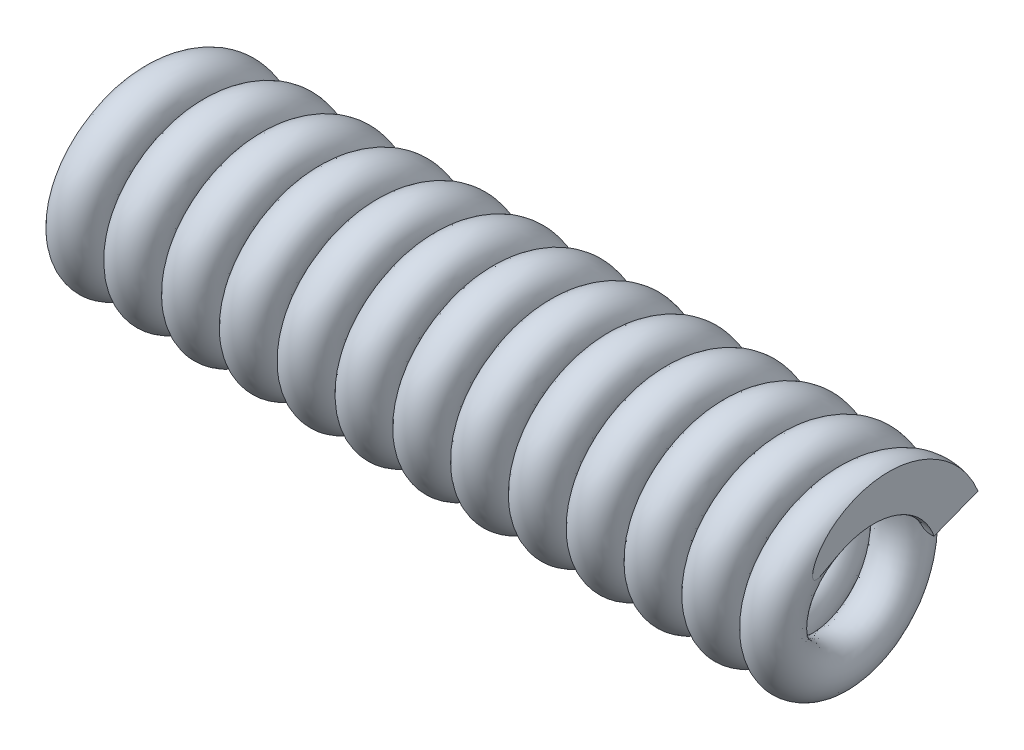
ISO-10303-21;
HEADER;
FILE_DESCRIPTION(('STEP AP214'),'2;1');
FILE_NAME('part.step','',(''),(''),'','','');
FILE_SCHEMA(('AUTOMOTIVE_DESIGN { 1 0 10303 214 1 1 1 1 }'));
ENDSEC;
DATA;
#1=APPLICATION_CONTEXT('core data for automotive mechanical design processes');
#2=APPLICATION_PROTOCOL_DEFINITION('international standard','automotive_design',2000,#1);
#3=PRODUCT_CONTEXT('',#1,'mechanical');
#4=PRODUCT('Part','Part','',(#3));
#5=PRODUCT_RELATED_PRODUCT_CATEGORY('part','',(#4));
#6=PRODUCT_DEFINITION_FORMATION('','',#4);
#7=PRODUCT_DEFINITION_CONTEXT('part definition',#1,'design');
#8=PRODUCT_DEFINITION('design','',#6,#7);
#9=PRODUCT_DEFINITION_SHAPE('','',#8);
#10=(LENGTH_UNIT() NAMED_UNIT(*) SI_UNIT(.MILLI.,.METRE.));
#11=(NAMED_UNIT(*) PLANE_ANGLE_UNIT() SI_UNIT($,.RADIAN.));
#12=(NAMED_UNIT(*) SI_UNIT($,.STERADIAN.) SOLID_ANGLE_UNIT());
#13=UNCERTAINTY_MEASURE_WITH_UNIT(LENGTH_MEASURE(1.E-05),#10,'distance_accuracy_value','');
#14=(GEOMETRIC_REPRESENTATION_CONTEXT(3) GLOBAL_UNCERTAINTY_ASSIGNED_CONTEXT((#13)) GLOBAL_UNIT_ASSIGNED_CONTEXT((#10,
#11,#12)) REPRESENTATION_CONTEXT('',''));
#15=CARTESIAN_POINT('',(0.,0.,0.));
#16=DIRECTION('',(0.,0.,1.));
#17=DIRECTION('',(1.,0.,0.));
#18=AXIS2_PLACEMENT_3D('',#15,#16,#17);
#19=CARTESIAN_POINT('',(5.58845575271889,0.278496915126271,-0.718883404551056));
#20=DIRECTION('',(0.,-0.932472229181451,-0.361241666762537));
#21=DIRECTION('',(0.,0.361241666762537,-0.932472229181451));
#22=AXIS2_PLACEMENT_3D('',#19,#20,#21);
#23=PLANE('',#22);
#24=CARTESIAN_POINT('',(5.58845575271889,0.214268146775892,-0.553089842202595));
#25=DIRECTION('',(0.,-0.932472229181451,-0.361241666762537));
#26=DIRECTION('',(0.,-0.361241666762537,0.932472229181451));
#27=AXIS2_PLACEMENT_3D('',#24,#25,#26);
#28=CIRCLE('',#27,0.1778);
#29=CARTESIAN_POINT('',(5.61340157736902,0.150670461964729,-0.388925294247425));
#30=VERTEX_POINT('',#29);
#31=CARTESIAN_POINT('',(5.61340147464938,0.277865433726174,-0.71725336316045));
#32=VERTEX_POINT('',#31);
#33=EDGE_CURVE('E39',#30,#32,#28,.T.);
#34=ORIENTED_EDGE('',*,*,#33,.T.);
#35=DIRECTION('',(0.,-0.361241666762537,0.932472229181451));
#36=VECTOR('',#35,1.);
#37=CARTESIAN_POINT('',(5.6134,0.278496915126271,-0.718883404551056));
#38=LINE('',#37,#36);
#39=EDGE_CURVE('E51',#32,#30,#38,.T.);
#40=ORIENTED_EDGE('',*,*,#39,.T.);
#41=EDGE_LOOP('',(#34,#40));
#42=FACE_BOUND('',#41,.T.);
#43=ADVANCED_FACE('F35',(#42),#23,.T.);
#44=CARTESIAN_POINT('',(0.,0.,-0.415343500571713));
#45=CARTESIAN_POINT('',(0.0359833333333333,-0.23979868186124,-0.415343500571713));
#46=CARTESIAN_POINT('',(0.0719666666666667,-0.35969802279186,-0.207671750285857));
#47=CARTESIAN_POINT('',(0.10795,-0.47959736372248,0.));
#48=CARTESIAN_POINT('',(0.143933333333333,-0.35969802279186,0.207671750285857));
#49=CARTESIAN_POINT('',(0.179916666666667,-0.23979868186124,0.415343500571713));
#50=CARTESIAN_POINT('',(0.2159,0.,0.415343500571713));
#51=CARTESIAN_POINT('',(0.251883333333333,0.23979868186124,0.415343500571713));
#52=CARTESIAN_POINT('',(0.287866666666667,0.35969802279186,0.207671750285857));
#53=CARTESIAN_POINT('',(0.32385,0.47959736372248,0.));
#54=CARTESIAN_POINT('',(0.359833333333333,0.359698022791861,-0.207671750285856));
#55=CARTESIAN_POINT('',(0.395816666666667,0.23979868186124,-0.415343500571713));
#56=CARTESIAN_POINT('',(0.4318,0.,-0.415343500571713));
#57=CARTESIAN_POINT('',(0.467783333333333,-0.23979868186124,-0.415343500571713));
#58=CARTESIAN_POINT('',(0.503766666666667,-0.35969802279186,-0.207671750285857));
#59=CARTESIAN_POINT('',(0.53975,-0.47959736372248,0.));
#60=CARTESIAN_POINT('',(0.575733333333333,-0.35969802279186,0.207671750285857));
#61=CARTESIAN_POINT('',(0.611716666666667,-0.23979868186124,0.415343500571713));
#62=CARTESIAN_POINT('',(0.6477,0.,0.415343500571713));
#63=CARTESIAN_POINT('',(0.683683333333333,0.23979868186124,0.415343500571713));
#64=CARTESIAN_POINT('',(0.719666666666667,0.35969802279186,0.207671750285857));
#65=CARTESIAN_POINT('',(0.75565,0.47959736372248,0.));
#66=CARTESIAN_POINT('',(0.791633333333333,0.359698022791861,-0.207671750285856));
#67=CARTESIAN_POINT('',(0.827616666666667,0.23979868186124,-0.415343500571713));
#68=CARTESIAN_POINT('',(0.8636,0.,-0.415343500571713));
#69=CARTESIAN_POINT('',(0.899583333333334,-0.23979868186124,-0.415343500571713));
#70=CARTESIAN_POINT('',(0.935566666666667,-0.35969802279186,-0.207671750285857));
#71=CARTESIAN_POINT('',(0.97155,-0.47959736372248,0.));
#72=CARTESIAN_POINT('',(1.00753333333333,-0.35969802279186,0.207671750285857));
#73=CARTESIAN_POINT('',(1.04351666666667,-0.23979868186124,0.415343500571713));
#74=CARTESIAN_POINT('',(1.0795,0.,0.415343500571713));
#75=CARTESIAN_POINT('',(1.11548333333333,0.23979868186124,0.415343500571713));
#76=CARTESIAN_POINT('',(1.15146666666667,0.35969802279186,0.207671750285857));
#77=CARTESIAN_POINT('',(1.18745,0.47959736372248,0.));
#78=CARTESIAN_POINT('',(1.22343333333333,0.359698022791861,-0.207671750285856));
#79=CARTESIAN_POINT('',(1.25941666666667,0.23979868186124,-0.415343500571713));
#80=CARTESIAN_POINT('',(1.2954,0.,-0.415343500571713));
#81=CARTESIAN_POINT('',(1.33138333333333,-0.23979868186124,-0.415343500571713));
#82=CARTESIAN_POINT('',(1.36736666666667,-0.35969802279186,-0.207671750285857));
#83=CARTESIAN_POINT('',(1.40335,-0.47959736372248,0.));
#84=CARTESIAN_POINT('',(1.43933333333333,-0.35969802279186,0.207671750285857));
#85=CARTESIAN_POINT('',(1.47531666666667,-0.23979868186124,0.415343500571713));
#86=CARTESIAN_POINT('',(1.5113,0.,0.415343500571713));
#87=CARTESIAN_POINT('',(1.54728333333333,0.23979868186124,0.415343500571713));
#88=CARTESIAN_POINT('',(1.58326666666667,0.35969802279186,0.207671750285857));
#89=CARTESIAN_POINT('',(1.61925,0.47959736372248,0.));
#90=CARTESIAN_POINT('',(1.65523333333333,0.359698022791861,-0.207671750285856));
#91=CARTESIAN_POINT('',(1.69121666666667,0.23979868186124,-0.415343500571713));
#92=CARTESIAN_POINT('',(1.7272,0.,-0.415343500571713));
#93=CARTESIAN_POINT('',(1.76318333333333,-0.23979868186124,-0.415343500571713));
#94=CARTESIAN_POINT('',(1.79916666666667,-0.35969802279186,-0.207671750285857));
#95=CARTESIAN_POINT('',(1.83515,-0.47959736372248,0.));
#96=CARTESIAN_POINT('',(1.87113333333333,-0.35969802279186,0.207671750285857));
#97=CARTESIAN_POINT('',(1.90711666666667,-0.23979868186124,0.415343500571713));
#98=CARTESIAN_POINT('',(1.9431,0.,0.415343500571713));
#99=CARTESIAN_POINT('',(1.97908333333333,0.23979868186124,0.415343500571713));
#100=CARTESIAN_POINT('',(2.01506666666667,0.35969802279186,0.207671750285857));
#101=CARTESIAN_POINT('',(2.05105,0.47959736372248,0.));
#102=CARTESIAN_POINT('',(2.08703333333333,0.359698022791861,-0.207671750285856));
#103=CARTESIAN_POINT('',(2.12301666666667,0.23979868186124,-0.415343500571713));
#104=CARTESIAN_POINT('',(2.159,0.,-0.415343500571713));
#105=CARTESIAN_POINT('',(2.19498333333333,-0.23979868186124,-0.415343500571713));
#106=CARTESIAN_POINT('',(2.23096666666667,-0.35969802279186,-0.207671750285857));
#107=CARTESIAN_POINT('',(2.26695,-0.47959736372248,0.));
#108=CARTESIAN_POINT('',(2.30293333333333,-0.35969802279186,0.207671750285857));
#109=CARTESIAN_POINT('',(2.33891666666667,-0.23979868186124,0.415343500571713));
#110=CARTESIAN_POINT('',(2.3749,0.,0.415343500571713));
#111=CARTESIAN_POINT('',(2.41088333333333,0.23979868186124,0.415343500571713));
#112=CARTESIAN_POINT('',(2.44686666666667,0.35969802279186,0.207671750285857));
#113=CARTESIAN_POINT('',(2.48285,0.47959736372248,0.));
#114=CARTESIAN_POINT('',(2.51883333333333,0.359698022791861,-0.207671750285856));
#115=CARTESIAN_POINT('',(2.55481666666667,0.23979868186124,-0.415343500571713));
#116=CARTESIAN_POINT('',(2.5908,0.,-0.415343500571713));
#117=CARTESIAN_POINT('',(2.62678333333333,-0.23979868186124,-0.415343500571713));
#118=CARTESIAN_POINT('',(2.66276666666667,-0.35969802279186,-0.207671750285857));
#119=CARTESIAN_POINT('',(2.69875,-0.47959736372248,0.));
#120=CARTESIAN_POINT('',(2.73473333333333,-0.35969802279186,0.207671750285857));
#121=CARTESIAN_POINT('',(2.77071666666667,-0.23979868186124,0.415343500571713));
#122=CARTESIAN_POINT('',(2.8067,0.,0.415343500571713));
#123=CARTESIAN_POINT('',(2.84268333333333,0.23979868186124,0.415343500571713));
#124=CARTESIAN_POINT('',(2.87866666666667,0.35969802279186,0.207671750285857));
#125=CARTESIAN_POINT('',(2.91465,0.47959736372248,0.));
#126=CARTESIAN_POINT('',(2.95063333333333,0.359698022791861,-0.207671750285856));
#127=CARTESIAN_POINT('',(2.98661666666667,0.23979868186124,-0.415343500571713));
#128=CARTESIAN_POINT('',(3.0226,0.,-0.415343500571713));
#129=CARTESIAN_POINT('',(3.05858333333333,-0.23979868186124,-0.415343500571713));
#130=CARTESIAN_POINT('',(3.09456666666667,-0.35969802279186,-0.207671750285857));
#131=CARTESIAN_POINT('',(3.13055,-0.47959736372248,0.));
#132=CARTESIAN_POINT('',(3.16653333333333,-0.35969802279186,0.207671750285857));
#133=CARTESIAN_POINT('',(3.20251666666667,-0.23979868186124,0.415343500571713));
#134=CARTESIAN_POINT('',(3.2385,0.,0.415343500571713));
#135=CARTESIAN_POINT('',(3.27448333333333,0.23979868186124,0.415343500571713));
#136=CARTESIAN_POINT('',(3.31046666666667,0.35969802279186,0.207671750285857));
#137=CARTESIAN_POINT('',(3.34645,0.47959736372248,0.));
#138=CARTESIAN_POINT('',(3.38243333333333,0.359698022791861,-0.207671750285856));
#139=CARTESIAN_POINT('',(3.41841666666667,0.23979868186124,-0.415343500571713));
#140=CARTESIAN_POINT('',(3.4544,0.,-0.415343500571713));
#141=CARTESIAN_POINT('',(3.49038333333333,-0.23979868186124,-0.415343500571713));
#142=CARTESIAN_POINT('',(3.52636666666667,-0.35969802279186,-0.207671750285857));
#143=CARTESIAN_POINT('',(3.56235,-0.47959736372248,0.));
#144=CARTESIAN_POINT('',(3.59833333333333,-0.35969802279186,0.207671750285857));
#145=CARTESIAN_POINT('',(3.63431666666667,-0.23979868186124,0.415343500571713));
#146=CARTESIAN_POINT('',(3.6703,0.,0.415343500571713));
#147=CARTESIAN_POINT('',(3.70628333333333,0.23979868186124,0.415343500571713));
#148=CARTESIAN_POINT('',(3.74226666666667,0.35969802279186,0.207671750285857));
#149=CARTESIAN_POINT('',(3.77825,0.47959736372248,0.));
#150=CARTESIAN_POINT('',(3.81423333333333,0.359698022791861,-0.207671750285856));
#151=CARTESIAN_POINT('',(3.85021666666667,0.23979868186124,-0.415343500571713));
#152=CARTESIAN_POINT('',(3.8862,0.,-0.415343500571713));
#153=CARTESIAN_POINT('',(3.92218333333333,-0.23979868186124,-0.415343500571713));
#154=CARTESIAN_POINT('',(3.95816666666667,-0.35969802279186,-0.207671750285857));
#155=CARTESIAN_POINT('',(3.99415,-0.47959736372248,0.));
#156=CARTESIAN_POINT('',(4.03013333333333,-0.35969802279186,0.207671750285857));
#157=CARTESIAN_POINT('',(4.06611666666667,-0.23979868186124,0.415343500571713));
#158=CARTESIAN_POINT('',(4.1021,0.,0.415343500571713));
#159=CARTESIAN_POINT('',(4.13808333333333,0.23979868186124,0.415343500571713));
#160=CARTESIAN_POINT('',(4.17406666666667,0.35969802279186,0.207671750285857));
#161=CARTESIAN_POINT('',(4.21005,0.47959736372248,0.));
#162=CARTESIAN_POINT('',(4.24603333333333,0.359698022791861,-0.207671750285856));
#163=CARTESIAN_POINT('',(4.28201666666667,0.23979868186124,-0.415343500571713));
#164=CARTESIAN_POINT('',(4.318,0.,-0.415343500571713));
#165=CARTESIAN_POINT('',(4.35398333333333,-0.23979868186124,-0.415343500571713));
#166=CARTESIAN_POINT('',(4.38996666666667,-0.35969802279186,-0.207671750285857));
#167=CARTESIAN_POINT('',(4.42595,-0.47959736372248,0.));
#168=CARTESIAN_POINT('',(4.46193333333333,-0.35969802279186,0.207671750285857));
#169=CARTESIAN_POINT('',(4.49791666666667,-0.23979868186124,0.415343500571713));
#170=CARTESIAN_POINT('',(4.5339,0.,0.415343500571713));
#171=CARTESIAN_POINT('',(4.56988333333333,0.23979868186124,0.415343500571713));
#172=CARTESIAN_POINT('',(4.60586666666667,0.35969802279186,0.207671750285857));
#173=CARTESIAN_POINT('',(4.64185,0.47959736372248,0.));
#174=CARTESIAN_POINT('',(4.67783333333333,0.359698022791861,-0.207671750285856));
#175=CARTESIAN_POINT('',(4.71381666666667,0.23979868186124,-0.415343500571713));
#176=CARTESIAN_POINT('',(4.7498,0.,-0.415343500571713));
#177=CARTESIAN_POINT('',(4.78578333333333,-0.23979868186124,-0.415343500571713));
#178=CARTESIAN_POINT('',(4.82176666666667,-0.35969802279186,-0.207671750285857));
#179=CARTESIAN_POINT('',(4.85775,-0.47959736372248,0.));
#180=CARTESIAN_POINT('',(4.89373333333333,-0.35969802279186,0.207671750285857));
#181=CARTESIAN_POINT('',(4.92971666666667,-0.23979868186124,0.415343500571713));
#182=CARTESIAN_POINT('',(4.9657,0.,0.415343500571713));
#183=CARTESIAN_POINT('',(5.00168333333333,0.23979868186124,0.415343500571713));
#184=CARTESIAN_POINT('',(5.03766666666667,0.35969802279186,0.207671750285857));
#185=CARTESIAN_POINT('',(5.07365,0.47959736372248,0.));
#186=CARTESIAN_POINT('',(5.10963333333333,0.359698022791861,-0.207671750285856));
#187=CARTESIAN_POINT('',(5.14561666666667,0.23979868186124,-0.415343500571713));
#188=CARTESIAN_POINT('',(5.1816,0.,-0.415343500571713));
#189=CARTESIAN_POINT('',(5.21758333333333,-0.23979868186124,-0.415343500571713));
#190=CARTESIAN_POINT('',(5.25356666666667,-0.35969802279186,-0.207671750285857));
#191=CARTESIAN_POINT('',(5.28955,-0.47959736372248,0.));
#192=CARTESIAN_POINT('',(5.32553333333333,-0.35969802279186,0.207671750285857));
#193=CARTESIAN_POINT('',(5.36151666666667,-0.23979868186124,0.415343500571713));
#194=CARTESIAN_POINT('',(5.3975,0.,0.415343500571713));
#195=CARTESIAN_POINT('',(5.43348333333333,0.23979868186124,0.415343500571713));
#196=CARTESIAN_POINT('',(5.46946666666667,0.35969802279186,0.207671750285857));
#197=CARTESIAN_POINT('',(5.50545,0.47959736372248,0.));
#198=CARTESIAN_POINT('',(5.54143333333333,0.359698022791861,-0.207671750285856));
#199=CARTESIAN_POINT('',(5.56339580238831,0.286517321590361,-0.334424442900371));
#200=CARTESIAN_POINT('',(5.58845575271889,0.150039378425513,-0.387296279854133));
#201=CARTESIAN_POINT('',(0.3556,0.,-0.415343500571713));
#202=CARTESIAN_POINT('',(0.391583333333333,-0.23979868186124,-0.415343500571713));
#203=CARTESIAN_POINT('',(0.427566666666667,-0.35969802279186,-0.207671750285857));
#204=CARTESIAN_POINT('',(0.46355,-0.47959736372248,0.));
#205=CARTESIAN_POINT('',(0.499533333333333,-0.35969802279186,0.207671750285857));
#206=CARTESIAN_POINT('',(0.535516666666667,-0.23979868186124,0.415343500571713));
#207=CARTESIAN_POINT('',(0.5715,0.,0.415343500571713));
#208=CARTESIAN_POINT('',(0.607483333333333,0.23979868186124,0.415343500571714));
#209=CARTESIAN_POINT('',(0.643466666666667,0.35969802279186,0.207671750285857));
#210=CARTESIAN_POINT('',(0.67945,0.47959736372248,0.));
#211=CARTESIAN_POINT('',(0.715433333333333,0.359698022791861,-0.207671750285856));
#212=CARTESIAN_POINT('',(0.751416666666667,0.23979868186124,-0.415343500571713));
#213=CARTESIAN_POINT('',(0.7874,0.,-0.415343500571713));
#214=CARTESIAN_POINT('',(0.823383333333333,-0.23979868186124,-0.415343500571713));
#215=CARTESIAN_POINT('',(0.859366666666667,-0.35969802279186,-0.207671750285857));
#216=CARTESIAN_POINT('',(0.89535,-0.47959736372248,0.));
#217=CARTESIAN_POINT('',(0.931333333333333,-0.35969802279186,0.207671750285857));
#218=CARTESIAN_POINT('',(0.967316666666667,-0.23979868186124,0.415343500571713));
#219=CARTESIAN_POINT('',(1.0033,0.,0.415343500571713));
#220=CARTESIAN_POINT('',(1.03928333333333,0.23979868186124,0.415343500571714));
#221=CARTESIAN_POINT('',(1.07526666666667,0.35969802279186,0.207671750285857));
#222=CARTESIAN_POINT('',(1.11125,0.47959736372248,0.));
#223=CARTESIAN_POINT('',(1.14723333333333,0.359698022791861,-0.207671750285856));
#224=CARTESIAN_POINT('',(1.18321666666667,0.23979868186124,-0.415343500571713));
#225=CARTESIAN_POINT('',(1.2192,0.,-0.415343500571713));
#226=CARTESIAN_POINT('',(1.25518333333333,-0.23979868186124,-0.415343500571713));
#227=CARTESIAN_POINT('',(1.29116666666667,-0.35969802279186,-0.207671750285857));
#228=CARTESIAN_POINT('',(1.32715,-0.47959736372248,0.));
#229=CARTESIAN_POINT('',(1.36313333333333,-0.35969802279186,0.207671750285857));
#230=CARTESIAN_POINT('',(1.39911666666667,-0.23979868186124,0.415343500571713));
#231=CARTESIAN_POINT('',(1.4351,0.,0.415343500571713));
#232=CARTESIAN_POINT('',(1.47108333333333,0.23979868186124,0.415343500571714));
#233=CARTESIAN_POINT('',(1.50706666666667,0.35969802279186,0.207671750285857));
#234=CARTESIAN_POINT('',(1.54305,0.47959736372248,0.));
#235=CARTESIAN_POINT('',(1.57903333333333,0.359698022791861,-0.207671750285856));
#236=CARTESIAN_POINT('',(1.61501666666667,0.23979868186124,-0.415343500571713));
#237=CARTESIAN_POINT('',(1.651,0.,-0.415343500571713));
#238=CARTESIAN_POINT('',(1.68698333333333,-0.23979868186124,-0.415343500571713));
#239=CARTESIAN_POINT('',(1.72296666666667,-0.35969802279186,-0.207671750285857));
#240=CARTESIAN_POINT('',(1.75895,-0.47959736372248,0.));
#241=CARTESIAN_POINT('',(1.79493333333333,-0.35969802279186,0.207671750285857));
#242=CARTESIAN_POINT('',(1.83091666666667,-0.23979868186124,0.415343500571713));
#243=CARTESIAN_POINT('',(1.8669,0.,0.415343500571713));
#244=CARTESIAN_POINT('',(1.90288333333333,0.23979868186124,0.415343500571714));
#245=CARTESIAN_POINT('',(1.93886666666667,0.35969802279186,0.207671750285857));
#246=CARTESIAN_POINT('',(1.97485,0.47959736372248,0.));
#247=CARTESIAN_POINT('',(2.01083333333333,0.359698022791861,-0.207671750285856));
#248=CARTESIAN_POINT('',(2.04681666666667,0.23979868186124,-0.415343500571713));
#249=CARTESIAN_POINT('',(2.0828,0.,-0.415343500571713));
#250=CARTESIAN_POINT('',(2.11878333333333,-0.23979868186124,-0.415343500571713));
#251=CARTESIAN_POINT('',(2.15476666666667,-0.35969802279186,-0.207671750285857));
#252=CARTESIAN_POINT('',(2.19075,-0.47959736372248,0.));
#253=CARTESIAN_POINT('',(2.22673333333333,-0.35969802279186,0.207671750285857));
#254=CARTESIAN_POINT('',(2.26271666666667,-0.23979868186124,0.415343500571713));
#255=CARTESIAN_POINT('',(2.2987,0.,0.415343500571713));
#256=CARTESIAN_POINT('',(2.33468333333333,0.23979868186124,0.415343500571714));
#257=CARTESIAN_POINT('',(2.37066666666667,0.35969802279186,0.207671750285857));
#258=CARTESIAN_POINT('',(2.40665,0.47959736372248,0.));
#259=CARTESIAN_POINT('',(2.44263333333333,0.359698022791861,-0.207671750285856));
#260=CARTESIAN_POINT('',(2.47861666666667,0.23979868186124,-0.415343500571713));
#261=CARTESIAN_POINT('',(2.5146,0.,-0.415343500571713));
#262=CARTESIAN_POINT('',(2.55058333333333,-0.23979868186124,-0.415343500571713));
#263=CARTESIAN_POINT('',(2.58656666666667,-0.35969802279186,-0.207671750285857));
#264=CARTESIAN_POINT('',(2.62255,-0.47959736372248,0.));
#265=CARTESIAN_POINT('',(2.65853333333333,-0.35969802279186,0.207671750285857));
#266=CARTESIAN_POINT('',(2.69451666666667,-0.23979868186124,0.415343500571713));
#267=CARTESIAN_POINT('',(2.7305,0.,0.415343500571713));
#268=CARTESIAN_POINT('',(2.76648333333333,0.23979868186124,0.415343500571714));
#269=CARTESIAN_POINT('',(2.80246666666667,0.35969802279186,0.207671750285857));
#270=CARTESIAN_POINT('',(2.83845,0.47959736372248,0.));
#271=CARTESIAN_POINT('',(2.87443333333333,0.359698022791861,-0.207671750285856));
#272=CARTESIAN_POINT('',(2.91041666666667,0.23979868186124,-0.415343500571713));
#273=CARTESIAN_POINT('',(2.9464,0.,-0.415343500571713));
#274=CARTESIAN_POINT('',(2.98238333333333,-0.23979868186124,-0.415343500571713));
#275=CARTESIAN_POINT('',(3.01836666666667,-0.35969802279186,-0.207671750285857));
#276=CARTESIAN_POINT('',(3.05435,-0.47959736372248,0.));
#277=CARTESIAN_POINT('',(3.09033333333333,-0.35969802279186,0.207671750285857));
#278=CARTESIAN_POINT('',(3.12631666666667,-0.23979868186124,0.415343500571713));
#279=CARTESIAN_POINT('',(3.1623,0.,0.415343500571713));
#280=CARTESIAN_POINT('',(3.19828333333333,0.23979868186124,0.415343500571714));
#281=CARTESIAN_POINT('',(3.23426666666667,0.35969802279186,0.207671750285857));
#282=CARTESIAN_POINT('',(3.27025,0.47959736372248,0.));
#283=CARTESIAN_POINT('',(3.30623333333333,0.359698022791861,-0.207671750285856));
#284=CARTESIAN_POINT('',(3.34221666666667,0.23979868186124,-0.415343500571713));
#285=CARTESIAN_POINT('',(3.3782,0.,-0.415343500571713));
#286=CARTESIAN_POINT('',(3.41418333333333,-0.23979868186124,-0.415343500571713));
#287=CARTESIAN_POINT('',(3.45016666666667,-0.35969802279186,-0.207671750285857));
#288=CARTESIAN_POINT('',(3.48615,-0.47959736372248,0.));
#289=CARTESIAN_POINT('',(3.52213333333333,-0.35969802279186,0.207671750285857));
#290=CARTESIAN_POINT('',(3.55811666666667,-0.23979868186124,0.415343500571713));
#291=CARTESIAN_POINT('',(3.5941,0.,0.415343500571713));
#292=CARTESIAN_POINT('',(3.63008333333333,0.23979868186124,0.415343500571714));
#293=CARTESIAN_POINT('',(3.66606666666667,0.35969802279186,0.207671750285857));
#294=CARTESIAN_POINT('',(3.70205,0.47959736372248,0.));
#295=CARTESIAN_POINT('',(3.73803333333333,0.359698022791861,-0.207671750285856));
#296=CARTESIAN_POINT('',(3.77401666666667,0.23979868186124,-0.415343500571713));
#297=CARTESIAN_POINT('',(3.81,0.,-0.415343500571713));
#298=CARTESIAN_POINT('',(3.84598333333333,-0.23979868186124,-0.415343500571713));
#299=CARTESIAN_POINT('',(3.88196666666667,-0.35969802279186,-0.207671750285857));
#300=CARTESIAN_POINT('',(3.91795,-0.47959736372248,0.));
#301=CARTESIAN_POINT('',(3.95393333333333,-0.35969802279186,0.207671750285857));
#302=CARTESIAN_POINT('',(3.98991666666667,-0.23979868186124,0.415343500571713));
#303=CARTESIAN_POINT('',(4.0259,0.,0.415343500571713));
#304=CARTESIAN_POINT('',(4.06188333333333,0.23979868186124,0.415343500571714));
#305=CARTESIAN_POINT('',(4.09786666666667,0.35969802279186,0.207671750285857));
#306=CARTESIAN_POINT('',(4.13385,0.47959736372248,0.));
#307=CARTESIAN_POINT('',(4.16983333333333,0.359698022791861,-0.207671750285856));
#308=CARTESIAN_POINT('',(4.20581666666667,0.23979868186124,-0.415343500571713));
#309=CARTESIAN_POINT('',(4.2418,0.,-0.415343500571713));
#310=CARTESIAN_POINT('',(4.27778333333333,-0.23979868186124,-0.415343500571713));
#311=CARTESIAN_POINT('',(4.31376666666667,-0.35969802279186,-0.207671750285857));
#312=CARTESIAN_POINT('',(4.34975,-0.47959736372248,0.));
#313=CARTESIAN_POINT('',(4.38573333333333,-0.35969802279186,0.207671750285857));
#314=CARTESIAN_POINT('',(4.42171666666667,-0.23979868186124,0.415343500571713));
#315=CARTESIAN_POINT('',(4.4577,0.,0.415343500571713));
#316=CARTESIAN_POINT('',(4.49368333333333,0.23979868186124,0.415343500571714));
#317=CARTESIAN_POINT('',(4.52966666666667,0.35969802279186,0.207671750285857));
#318=CARTESIAN_POINT('',(4.56565,0.47959736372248,0.));
#319=CARTESIAN_POINT('',(4.60163333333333,0.359698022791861,-0.207671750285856));
#320=CARTESIAN_POINT('',(4.63761666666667,0.23979868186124,-0.415343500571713));
#321=CARTESIAN_POINT('',(4.6736,0.,-0.415343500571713));
#322=CARTESIAN_POINT('',(4.70958333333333,-0.23979868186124,-0.415343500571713));
#323=CARTESIAN_POINT('',(4.74556666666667,-0.35969802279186,-0.207671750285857));
#324=CARTESIAN_POINT('',(4.78155,-0.47959736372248,0.));
#325=CARTESIAN_POINT('',(4.81753333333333,-0.35969802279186,0.207671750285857));
#326=CARTESIAN_POINT('',(4.85351666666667,-0.23979868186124,0.415343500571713));
#327=CARTESIAN_POINT('',(4.8895,0.,0.415343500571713));
#328=CARTESIAN_POINT('',(4.92548333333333,0.23979868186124,0.415343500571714));
#329=CARTESIAN_POINT('',(4.96146666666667,0.35969802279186,0.207671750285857));
#330=CARTESIAN_POINT('',(4.99745,0.47959736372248,0.));
#331=CARTESIAN_POINT('',(5.03343333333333,0.359698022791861,-0.207671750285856));
#332=CARTESIAN_POINT('',(5.06941666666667,0.23979868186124,-0.415343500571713));
#333=CARTESIAN_POINT('',(5.1054,0.,-0.415343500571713));
#334=CARTESIAN_POINT('',(5.14138333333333,-0.23979868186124,-0.415343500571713));
#335=CARTESIAN_POINT('',(5.17736666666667,-0.35969802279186,-0.207671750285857));
#336=CARTESIAN_POINT('',(5.21335,-0.47959736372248,0.));
#337=CARTESIAN_POINT('',(5.24933333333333,-0.35969802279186,0.207671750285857));
#338=CARTESIAN_POINT('',(5.28531666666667,-0.23979868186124,0.415343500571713));
#339=CARTESIAN_POINT('',(5.3213,0.,0.415343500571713));
#340=CARTESIAN_POINT('',(5.35728333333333,0.23979868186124,0.415343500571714));
#341=CARTESIAN_POINT('',(5.39326666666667,0.35969802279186,0.207671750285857));
#342=CARTESIAN_POINT('',(5.42925,0.47959736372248,0.));
#343=CARTESIAN_POINT('',(5.46523333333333,0.359698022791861,-0.207671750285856));
#344=CARTESIAN_POINT('',(5.50121666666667,0.23979868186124,-0.415343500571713));
#345=CARTESIAN_POINT('',(5.5372,0.,-0.415343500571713));
#346=CARTESIAN_POINT('',(5.57318333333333,-0.23979868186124,-0.415343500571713));
#347=CARTESIAN_POINT('',(5.60916666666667,-0.35969802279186,-0.207671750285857));
#348=CARTESIAN_POINT('',(5.64515,-0.47959736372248,0.));
#349=CARTESIAN_POINT('',(5.68113333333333,-0.35969802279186,0.207671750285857));
#350=CARTESIAN_POINT('',(5.71711666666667,-0.23979868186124,0.415343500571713));
#351=CARTESIAN_POINT('',(5.7531,0.,0.415343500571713));
#352=CARTESIAN_POINT('',(5.78908333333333,0.23979868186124,0.415343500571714));
#353=CARTESIAN_POINT('',(5.82506666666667,0.35969802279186,0.207671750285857));
#354=CARTESIAN_POINT('',(5.86105,0.47959736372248,0.));
#355=CARTESIAN_POINT('',(5.89703333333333,0.359698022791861,-0.207671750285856));
#356=CARTESIAN_POINT('',(5.91899580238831,0.286517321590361,-0.334424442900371));
#357=CARTESIAN_POINT('',(5.94405575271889,0.150039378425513,-0.387296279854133));
#358=CARTESIAN_POINT('',(0.3556,0.,-0.770943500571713));
#359=CARTESIAN_POINT('',(0.391583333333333,-0.445104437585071,-0.770943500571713));
#360=CARTESIAN_POINT('',(0.427566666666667,-0.667656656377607,-0.385471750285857));
#361=CARTESIAN_POINT('',(0.46355,-0.890208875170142,0.));
#362=CARTESIAN_POINT('',(0.499533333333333,-0.667656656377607,0.385471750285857));
#363=CARTESIAN_POINT('',(0.535516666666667,-0.445104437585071,0.770943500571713));
#364=CARTESIAN_POINT('',(0.5715,0.,0.770943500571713));
#365=CARTESIAN_POINT('',(0.607483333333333,0.445104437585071,0.770943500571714));
#366=CARTESIAN_POINT('',(0.643466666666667,0.667656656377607,0.385471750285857));
#367=CARTESIAN_POINT('',(0.67945,0.890208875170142,0.));
#368=CARTESIAN_POINT('',(0.715433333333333,0.667656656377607,-0.385471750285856));
#369=CARTESIAN_POINT('',(0.751416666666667,0.445104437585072,-0.770943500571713));
#370=CARTESIAN_POINT('',(0.7874,0.,-0.770943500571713));
#371=CARTESIAN_POINT('',(0.823383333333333,-0.445104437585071,-0.770943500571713));
#372=CARTESIAN_POINT('',(0.859366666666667,-0.667656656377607,-0.385471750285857));
#373=CARTESIAN_POINT('',(0.89535,-0.890208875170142,0.));
#374=CARTESIAN_POINT('',(0.931333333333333,-0.667656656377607,0.385471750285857));
#375=CARTESIAN_POINT('',(0.967316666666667,-0.445104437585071,0.770943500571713));
#376=CARTESIAN_POINT('',(1.0033,0.,0.770943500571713));
#377=CARTESIAN_POINT('',(1.03928333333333,0.445104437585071,0.770943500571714));
#378=CARTESIAN_POINT('',(1.07526666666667,0.667656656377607,0.385471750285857));
#379=CARTESIAN_POINT('',(1.11125,0.890208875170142,0.));
#380=CARTESIAN_POINT('',(1.14723333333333,0.667656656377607,-0.385471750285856));
#381=CARTESIAN_POINT('',(1.18321666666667,0.445104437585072,-0.770943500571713));
#382=CARTESIAN_POINT('',(1.2192,0.,-0.770943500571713));
#383=CARTESIAN_POINT('',(1.25518333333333,-0.445104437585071,-0.770943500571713));
#384=CARTESIAN_POINT('',(1.29116666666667,-0.667656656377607,-0.385471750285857));
#385=CARTESIAN_POINT('',(1.32715,-0.890208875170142,0.));
#386=CARTESIAN_POINT('',(1.36313333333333,-0.667656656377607,0.385471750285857));
#387=CARTESIAN_POINT('',(1.39911666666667,-0.445104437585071,0.770943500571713));
#388=CARTESIAN_POINT('',(1.4351,0.,0.770943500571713));
#389=CARTESIAN_POINT('',(1.47108333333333,0.445104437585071,0.770943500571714));
#390=CARTESIAN_POINT('',(1.50706666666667,0.667656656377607,0.385471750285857));
#391=CARTESIAN_POINT('',(1.54305,0.890208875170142,0.));
#392=CARTESIAN_POINT('',(1.57903333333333,0.667656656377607,-0.385471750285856));
#393=CARTESIAN_POINT('',(1.61501666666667,0.445104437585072,-0.770943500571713));
#394=CARTESIAN_POINT('',(1.651,0.,-0.770943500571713));
#395=CARTESIAN_POINT('',(1.68698333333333,-0.445104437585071,-0.770943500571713));
#396=CARTESIAN_POINT('',(1.72296666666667,-0.667656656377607,-0.385471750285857));
#397=CARTESIAN_POINT('',(1.75895,-0.890208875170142,0.));
#398=CARTESIAN_POINT('',(1.79493333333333,-0.667656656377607,0.385471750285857));
#399=CARTESIAN_POINT('',(1.83091666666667,-0.445104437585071,0.770943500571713));
#400=CARTESIAN_POINT('',(1.8669,0.,0.770943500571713));
#401=CARTESIAN_POINT('',(1.90288333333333,0.445104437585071,0.770943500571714));
#402=CARTESIAN_POINT('',(1.93886666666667,0.667656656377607,0.385471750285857));
#403=CARTESIAN_POINT('',(1.97485,0.890208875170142,0.));
#404=CARTESIAN_POINT('',(2.01083333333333,0.667656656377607,-0.385471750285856));
#405=CARTESIAN_POINT('',(2.04681666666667,0.445104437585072,-0.770943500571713));
#406=CARTESIAN_POINT('',(2.0828,0.,-0.770943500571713));
#407=CARTESIAN_POINT('',(2.11878333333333,-0.445104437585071,-0.770943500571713));
#408=CARTESIAN_POINT('',(2.15476666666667,-0.667656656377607,-0.385471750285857));
#409=CARTESIAN_POINT('',(2.19075,-0.890208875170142,0.));
#410=CARTESIAN_POINT('',(2.22673333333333,-0.667656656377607,0.385471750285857));
#411=CARTESIAN_POINT('',(2.26271666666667,-0.445104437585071,0.770943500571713));
#412=CARTESIAN_POINT('',(2.2987,0.,0.770943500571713));
#413=CARTESIAN_POINT('',(2.33468333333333,0.445104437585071,0.770943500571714));
#414=CARTESIAN_POINT('',(2.37066666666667,0.667656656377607,0.385471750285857));
#415=CARTESIAN_POINT('',(2.40665,0.890208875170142,0.));
#416=CARTESIAN_POINT('',(2.44263333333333,0.667656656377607,-0.385471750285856));
#417=CARTESIAN_POINT('',(2.47861666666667,0.445104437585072,-0.770943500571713));
#418=CARTESIAN_POINT('',(2.5146,0.,-0.770943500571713));
#419=CARTESIAN_POINT('',(2.55058333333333,-0.445104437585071,-0.770943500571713));
#420=CARTESIAN_POINT('',(2.58656666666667,-0.667656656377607,-0.385471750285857));
#421=CARTESIAN_POINT('',(2.62255,-0.890208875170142,0.));
#422=CARTESIAN_POINT('',(2.65853333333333,-0.667656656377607,0.385471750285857));
#423=CARTESIAN_POINT('',(2.69451666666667,-0.445104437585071,0.770943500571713));
#424=CARTESIAN_POINT('',(2.7305,0.,0.770943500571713));
#425=CARTESIAN_POINT('',(2.76648333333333,0.445104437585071,0.770943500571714));
#426=CARTESIAN_POINT('',(2.80246666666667,0.667656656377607,0.385471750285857));
#427=CARTESIAN_POINT('',(2.83845,0.890208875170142,0.));
#428=CARTESIAN_POINT('',(2.87443333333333,0.667656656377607,-0.385471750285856));
#429=CARTESIAN_POINT('',(2.91041666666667,0.445104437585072,-0.770943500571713));
#430=CARTESIAN_POINT('',(2.9464,0.,-0.770943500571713));
#431=CARTESIAN_POINT('',(2.98238333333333,-0.445104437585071,-0.770943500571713));
#432=CARTESIAN_POINT('',(3.01836666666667,-0.667656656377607,-0.385471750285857));
#433=CARTESIAN_POINT('',(3.05435,-0.890208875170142,0.));
#434=CARTESIAN_POINT('',(3.09033333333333,-0.667656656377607,0.385471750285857));
#435=CARTESIAN_POINT('',(3.12631666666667,-0.445104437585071,0.770943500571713));
#436=CARTESIAN_POINT('',(3.1623,0.,0.770943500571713));
#437=CARTESIAN_POINT('',(3.19828333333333,0.445104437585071,0.770943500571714));
#438=CARTESIAN_POINT('',(3.23426666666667,0.667656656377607,0.385471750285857));
#439=CARTESIAN_POINT('',(3.27025,0.890208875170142,0.));
#440=CARTESIAN_POINT('',(3.30623333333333,0.667656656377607,-0.385471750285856));
#441=CARTESIAN_POINT('',(3.34221666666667,0.445104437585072,-0.770943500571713));
#442=CARTESIAN_POINT('',(3.3782,0.,-0.770943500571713));
#443=CARTESIAN_POINT('',(3.41418333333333,-0.445104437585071,-0.770943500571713));
#444=CARTESIAN_POINT('',(3.45016666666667,-0.667656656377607,-0.385471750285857));
#445=CARTESIAN_POINT('',(3.48615,-0.890208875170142,0.));
#446=CARTESIAN_POINT('',(3.52213333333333,-0.667656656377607,0.385471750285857));
#447=CARTESIAN_POINT('',(3.55811666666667,-0.445104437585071,0.770943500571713));
#448=CARTESIAN_POINT('',(3.5941,0.,0.770943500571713));
#449=CARTESIAN_POINT('',(3.63008333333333,0.445104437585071,0.770943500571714));
#450=CARTESIAN_POINT('',(3.66606666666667,0.667656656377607,0.385471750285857));
#451=CARTESIAN_POINT('',(3.70205,0.890208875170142,0.));
#452=CARTESIAN_POINT('',(3.73803333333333,0.667656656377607,-0.385471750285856));
#453=CARTESIAN_POINT('',(3.77401666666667,0.445104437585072,-0.770943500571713));
#454=CARTESIAN_POINT('',(3.81,0.,-0.770943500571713));
#455=CARTESIAN_POINT('',(3.84598333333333,-0.445104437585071,-0.770943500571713));
#456=CARTESIAN_POINT('',(3.88196666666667,-0.667656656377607,-0.385471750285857));
#457=CARTESIAN_POINT('',(3.91795,-0.890208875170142,0.));
#458=CARTESIAN_POINT('',(3.95393333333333,-0.667656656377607,0.385471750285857));
#459=CARTESIAN_POINT('',(3.98991666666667,-0.445104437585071,0.770943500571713));
#460=CARTESIAN_POINT('',(4.0259,0.,0.770943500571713));
#461=CARTESIAN_POINT('',(4.06188333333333,0.445104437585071,0.770943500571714));
#462=CARTESIAN_POINT('',(4.09786666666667,0.667656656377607,0.385471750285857));
#463=CARTESIAN_POINT('',(4.13385,0.890208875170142,0.));
#464=CARTESIAN_POINT('',(4.16983333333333,0.667656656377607,-0.385471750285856));
#465=CARTESIAN_POINT('',(4.20581666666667,0.445104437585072,-0.770943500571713));
#466=CARTESIAN_POINT('',(4.2418,0.,-0.770943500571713));
#467=CARTESIAN_POINT('',(4.27778333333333,-0.445104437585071,-0.770943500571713));
#468=CARTESIAN_POINT('',(4.31376666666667,-0.667656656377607,-0.385471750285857));
#469=CARTESIAN_POINT('',(4.34975,-0.890208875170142,0.));
#470=CARTESIAN_POINT('',(4.38573333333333,-0.667656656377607,0.385471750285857));
#471=CARTESIAN_POINT('',(4.42171666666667,-0.445104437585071,0.770943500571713));
#472=CARTESIAN_POINT('',(4.4577,0.,0.770943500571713));
#473=CARTESIAN_POINT('',(4.49368333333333,0.445104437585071,0.770943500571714));
#474=CARTESIAN_POINT('',(4.52966666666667,0.667656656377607,0.385471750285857));
#475=CARTESIAN_POINT('',(4.56565,0.890208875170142,0.));
#476=CARTESIAN_POINT('',(4.60163333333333,0.667656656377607,-0.385471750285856));
#477=CARTESIAN_POINT('',(4.63761666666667,0.445104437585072,-0.770943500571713));
#478=CARTESIAN_POINT('',(4.6736,0.,-0.770943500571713));
#479=CARTESIAN_POINT('',(4.70958333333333,-0.445104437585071,-0.770943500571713));
#480=CARTESIAN_POINT('',(4.74556666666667,-0.667656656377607,-0.385471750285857));
#481=CARTESIAN_POINT('',(4.78155,-0.890208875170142,0.));
#482=CARTESIAN_POINT('',(4.81753333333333,-0.667656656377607,0.385471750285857));
#483=CARTESIAN_POINT('',(4.85351666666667,-0.445104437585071,0.770943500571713));
#484=CARTESIAN_POINT('',(4.8895,0.,0.770943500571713));
#485=CARTESIAN_POINT('',(4.92548333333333,0.445104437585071,0.770943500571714));
#486=CARTESIAN_POINT('',(4.96146666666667,0.667656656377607,0.385471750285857));
#487=CARTESIAN_POINT('',(4.99745,0.890208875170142,0.));
#488=CARTESIAN_POINT('',(5.03343333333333,0.667656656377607,-0.385471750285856));
#489=CARTESIAN_POINT('',(5.06941666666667,0.445104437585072,-0.770943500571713));
#490=CARTESIAN_POINT('',(5.1054,0.,-0.770943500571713));
#491=CARTESIAN_POINT('',(5.14138333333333,-0.445104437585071,-0.770943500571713));
#492=CARTESIAN_POINT('',(5.17736666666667,-0.667656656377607,-0.385471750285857));
#493=CARTESIAN_POINT('',(5.21335,-0.890208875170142,0.));
#494=CARTESIAN_POINT('',(5.24933333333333,-0.667656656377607,0.385471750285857));
#495=CARTESIAN_POINT('',(5.28531666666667,-0.445104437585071,0.770943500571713));
#496=CARTESIAN_POINT('',(5.3213,0.,0.770943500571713));
#497=CARTESIAN_POINT('',(5.35728333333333,0.445104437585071,0.770943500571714));
#498=CARTESIAN_POINT('',(5.39326666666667,0.667656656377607,0.385471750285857));
#499=CARTESIAN_POINT('',(5.42925,0.890208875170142,0.));
#500=CARTESIAN_POINT('',(5.46523333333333,0.667656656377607,-0.385471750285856));
#501=CARTESIAN_POINT('',(5.50121666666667,0.445104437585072,-0.770943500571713));
#502=CARTESIAN_POINT('',(5.5372,0.,-0.770943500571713));
#503=CARTESIAN_POINT('',(5.57318333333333,-0.445104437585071,-0.770943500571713));
#504=CARTESIAN_POINT('',(5.60916666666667,-0.667656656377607,-0.385471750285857));
#505=CARTESIAN_POINT('',(5.64515,-0.890208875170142,0.));
#506=CARTESIAN_POINT('',(5.68113333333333,-0.667656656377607,0.385471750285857));
#507=CARTESIAN_POINT('',(5.71711666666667,-0.445104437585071,0.770943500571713));
#508=CARTESIAN_POINT('',(5.7531,0.,0.770943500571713));
#509=CARTESIAN_POINT('',(5.78908333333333,0.445104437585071,0.770943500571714));
#510=CARTESIAN_POINT('',(5.82506666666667,0.667656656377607,0.385471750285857));
#511=CARTESIAN_POINT('',(5.86105,0.890208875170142,0.));
#512=CARTESIAN_POINT('',(5.89703333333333,0.667656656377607,-0.385471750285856));
#513=CARTESIAN_POINT('',(5.91899580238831,0.531821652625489,-0.620744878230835));
#514=CARTESIAN_POINT('',(5.94405575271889,0.278496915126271,-0.718883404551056));
#515=CARTESIAN_POINT('',(0.,0.,-0.770943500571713));
#516=CARTESIAN_POINT('',(0.0359833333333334,-0.445104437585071,-0.770943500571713));
#517=CARTESIAN_POINT('',(0.0719666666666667,-0.667656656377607,-0.385471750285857));
#518=CARTESIAN_POINT('',(0.10795,-0.890208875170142,0.));
#519=CARTESIAN_POINT('',(0.143933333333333,-0.667656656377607,0.385471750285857));
#520=CARTESIAN_POINT('',(0.179916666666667,-0.445104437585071,0.770943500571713));
#521=CARTESIAN_POINT('',(0.2159,0.,0.770943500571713));
#522=CARTESIAN_POINT('',(0.251883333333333,0.445104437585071,0.770943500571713));
#523=CARTESIAN_POINT('',(0.287866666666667,0.667656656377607,0.385471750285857));
#524=CARTESIAN_POINT('',(0.32385,0.890208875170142,0.));
#525=CARTESIAN_POINT('',(0.359833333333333,0.667656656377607,-0.385471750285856));
#526=CARTESIAN_POINT('',(0.395816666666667,0.445104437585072,-0.770943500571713));
#527=CARTESIAN_POINT('',(0.4318,0.,-0.770943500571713));
#528=CARTESIAN_POINT('',(0.467783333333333,-0.445104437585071,-0.770943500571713));
#529=CARTESIAN_POINT('',(0.503766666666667,-0.667656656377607,-0.385471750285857));
#530=CARTESIAN_POINT('',(0.53975,-0.890208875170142,0.));
#531=CARTESIAN_POINT('',(0.575733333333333,-0.667656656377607,0.385471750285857));
#532=CARTESIAN_POINT('',(0.611716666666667,-0.445104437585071,0.770943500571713));
#533=CARTESIAN_POINT('',(0.6477,0.,0.770943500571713));
#534=CARTESIAN_POINT('',(0.683683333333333,0.445104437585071,0.770943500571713));
#535=CARTESIAN_POINT('',(0.719666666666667,0.667656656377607,0.385471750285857));
#536=CARTESIAN_POINT('',(0.75565,0.890208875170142,0.));
#537=CARTESIAN_POINT('',(0.791633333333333,0.667656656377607,-0.385471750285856));
#538=CARTESIAN_POINT('',(0.827616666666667,0.445104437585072,-0.770943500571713));
#539=CARTESIAN_POINT('',(0.8636,0.,-0.770943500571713));
#540=CARTESIAN_POINT('',(0.899583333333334,-0.445104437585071,-0.770943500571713));
#541=CARTESIAN_POINT('',(0.935566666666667,-0.667656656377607,-0.385471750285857));
#542=CARTESIAN_POINT('',(0.97155,-0.890208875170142,0.));
#543=CARTESIAN_POINT('',(1.00753333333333,-0.667656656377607,0.385471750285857));
#544=CARTESIAN_POINT('',(1.04351666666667,-0.445104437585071,0.770943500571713));
#545=CARTESIAN_POINT('',(1.0795,0.,0.770943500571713));
#546=CARTESIAN_POINT('',(1.11548333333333,0.445104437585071,0.770943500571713));
#547=CARTESIAN_POINT('',(1.15146666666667,0.667656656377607,0.385471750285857));
#548=CARTESIAN_POINT('',(1.18745,0.890208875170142,0.));
#549=CARTESIAN_POINT('',(1.22343333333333,0.667656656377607,-0.385471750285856));
#550=CARTESIAN_POINT('',(1.25941666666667,0.445104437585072,-0.770943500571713));
#551=CARTESIAN_POINT('',(1.2954,0.,-0.770943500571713));
#552=CARTESIAN_POINT('',(1.33138333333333,-0.445104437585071,-0.770943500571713));
#553=CARTESIAN_POINT('',(1.36736666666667,-0.667656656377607,-0.385471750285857));
#554=CARTESIAN_POINT('',(1.40335,-0.890208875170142,0.));
#555=CARTESIAN_POINT('',(1.43933333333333,-0.667656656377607,0.385471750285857));
#556=CARTESIAN_POINT('',(1.47531666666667,-0.445104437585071,0.770943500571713));
#557=CARTESIAN_POINT('',(1.5113,0.,0.770943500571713));
#558=CARTESIAN_POINT('',(1.54728333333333,0.445104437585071,0.770943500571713));
#559=CARTESIAN_POINT('',(1.58326666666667,0.667656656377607,0.385471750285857));
#560=CARTESIAN_POINT('',(1.61925,0.890208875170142,0.));
#561=CARTESIAN_POINT('',(1.65523333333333,0.667656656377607,-0.385471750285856));
#562=CARTESIAN_POINT('',(1.69121666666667,0.445104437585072,-0.770943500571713));
#563=CARTESIAN_POINT('',(1.7272,0.,-0.770943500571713));
#564=CARTESIAN_POINT('',(1.76318333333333,-0.445104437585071,-0.770943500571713));
#565=CARTESIAN_POINT('',(1.79916666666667,-0.667656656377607,-0.385471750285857));
#566=CARTESIAN_POINT('',(1.83515,-0.890208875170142,0.));
#567=CARTESIAN_POINT('',(1.87113333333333,-0.667656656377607,0.385471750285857));
#568=CARTESIAN_POINT('',(1.90711666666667,-0.445104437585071,0.770943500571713));
#569=CARTESIAN_POINT('',(1.9431,0.,0.770943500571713));
#570=CARTESIAN_POINT('',(1.97908333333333,0.445104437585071,0.770943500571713));
#571=CARTESIAN_POINT('',(2.01506666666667,0.667656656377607,0.385471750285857));
#572=CARTESIAN_POINT('',(2.05105,0.890208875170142,0.));
#573=CARTESIAN_POINT('',(2.08703333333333,0.667656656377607,-0.385471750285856));
#574=CARTESIAN_POINT('',(2.12301666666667,0.445104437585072,-0.770943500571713));
#575=CARTESIAN_POINT('',(2.159,0.,-0.770943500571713));
#576=CARTESIAN_POINT('',(2.19498333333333,-0.445104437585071,-0.770943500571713));
#577=CARTESIAN_POINT('',(2.23096666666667,-0.667656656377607,-0.385471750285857));
#578=CARTESIAN_POINT('',(2.26695,-0.890208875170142,0.));
#579=CARTESIAN_POINT('',(2.30293333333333,-0.667656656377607,0.385471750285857));
#580=CARTESIAN_POINT('',(2.33891666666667,-0.445104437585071,0.770943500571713));
#581=CARTESIAN_POINT('',(2.3749,0.,0.770943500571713));
#582=CARTESIAN_POINT('',(2.41088333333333,0.445104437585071,0.770943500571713));
#583=CARTESIAN_POINT('',(2.44686666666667,0.667656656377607,0.385471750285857));
#584=CARTESIAN_POINT('',(2.48285,0.890208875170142,0.));
#585=CARTESIAN_POINT('',(2.51883333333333,0.667656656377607,-0.385471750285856));
#586=CARTESIAN_POINT('',(2.55481666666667,0.445104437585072,-0.770943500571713));
#587=CARTESIAN_POINT('',(2.5908,0.,-0.770943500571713));
#588=CARTESIAN_POINT('',(2.62678333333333,-0.445104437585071,-0.770943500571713));
#589=CARTESIAN_POINT('',(2.66276666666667,-0.667656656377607,-0.385471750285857));
#590=CARTESIAN_POINT('',(2.69875,-0.890208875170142,0.));
#591=CARTESIAN_POINT('',(2.73473333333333,-0.667656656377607,0.385471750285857));
#592=CARTESIAN_POINT('',(2.77071666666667,-0.445104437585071,0.770943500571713));
#593=CARTESIAN_POINT('',(2.8067,0.,0.770943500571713));
#594=CARTESIAN_POINT('',(2.84268333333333,0.445104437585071,0.770943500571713));
#595=CARTESIAN_POINT('',(2.87866666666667,0.667656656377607,0.385471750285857));
#596=CARTESIAN_POINT('',(2.91465,0.890208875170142,0.));
#597=CARTESIAN_POINT('',(2.95063333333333,0.667656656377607,-0.385471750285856));
#598=CARTESIAN_POINT('',(2.98661666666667,0.445104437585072,-0.770943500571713));
#599=CARTESIAN_POINT('',(3.0226,0.,-0.770943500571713));
#600=CARTESIAN_POINT('',(3.05858333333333,-0.445104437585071,-0.770943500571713));
#601=CARTESIAN_POINT('',(3.09456666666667,-0.667656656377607,-0.385471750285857));
#602=CARTESIAN_POINT('',(3.13055,-0.890208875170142,0.));
#603=CARTESIAN_POINT('',(3.16653333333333,-0.667656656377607,0.385471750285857));
#604=CARTESIAN_POINT('',(3.20251666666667,-0.445104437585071,0.770943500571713));
#605=CARTESIAN_POINT('',(3.2385,0.,0.770943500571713));
#606=CARTESIAN_POINT('',(3.27448333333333,0.445104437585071,0.770943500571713));
#607=CARTESIAN_POINT('',(3.31046666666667,0.667656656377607,0.385471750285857));
#608=CARTESIAN_POINT('',(3.34645,0.890208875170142,0.));
#609=CARTESIAN_POINT('',(3.38243333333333,0.667656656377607,-0.385471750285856));
#610=CARTESIAN_POINT('',(3.41841666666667,0.445104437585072,-0.770943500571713));
#611=CARTESIAN_POINT('',(3.4544,0.,-0.770943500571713));
#612=CARTESIAN_POINT('',(3.49038333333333,-0.445104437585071,-0.770943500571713));
#613=CARTESIAN_POINT('',(3.52636666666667,-0.667656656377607,-0.385471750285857));
#614=CARTESIAN_POINT('',(3.56235,-0.890208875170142,0.));
#615=CARTESIAN_POINT('',(3.59833333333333,-0.667656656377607,0.385471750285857));
#616=CARTESIAN_POINT('',(3.63431666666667,-0.445104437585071,0.770943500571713));
#617=CARTESIAN_POINT('',(3.6703,0.,0.770943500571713));
#618=CARTESIAN_POINT('',(3.70628333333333,0.445104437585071,0.770943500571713));
#619=CARTESIAN_POINT('',(3.74226666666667,0.667656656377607,0.385471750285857));
#620=CARTESIAN_POINT('',(3.77825,0.890208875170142,0.));
#621=CARTESIAN_POINT('',(3.81423333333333,0.667656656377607,-0.385471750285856));
#622=CARTESIAN_POINT('',(3.85021666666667,0.445104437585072,-0.770943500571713));
#623=CARTESIAN_POINT('',(3.8862,0.,-0.770943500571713));
#624=CARTESIAN_POINT('',(3.92218333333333,-0.445104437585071,-0.770943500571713));
#625=CARTESIAN_POINT('',(3.95816666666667,-0.667656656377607,-0.385471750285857));
#626=CARTESIAN_POINT('',(3.99415,-0.890208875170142,0.));
#627=CARTESIAN_POINT('',(4.03013333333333,-0.667656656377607,0.385471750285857));
#628=CARTESIAN_POINT('',(4.06611666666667,-0.445104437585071,0.770943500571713));
#629=CARTESIAN_POINT('',(4.1021,0.,0.770943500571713));
#630=CARTESIAN_POINT('',(4.13808333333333,0.445104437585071,0.770943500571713));
#631=CARTESIAN_POINT('',(4.17406666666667,0.667656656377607,0.385471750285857));
#632=CARTESIAN_POINT('',(4.21005,0.890208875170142,0.));
#633=CARTESIAN_POINT('',(4.24603333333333,0.667656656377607,-0.385471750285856));
#634=CARTESIAN_POINT('',(4.28201666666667,0.445104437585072,-0.770943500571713));
#635=CARTESIAN_POINT('',(4.318,0.,-0.770943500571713));
#636=CARTESIAN_POINT('',(4.35398333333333,-0.445104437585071,-0.770943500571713));
#637=CARTESIAN_POINT('',(4.38996666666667,-0.667656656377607,-0.385471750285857));
#638=CARTESIAN_POINT('',(4.42595,-0.890208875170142,0.));
#639=CARTESIAN_POINT('',(4.46193333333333,-0.667656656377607,0.385471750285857));
#640=CARTESIAN_POINT('',(4.49791666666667,-0.445104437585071,0.770943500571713));
#641=CARTESIAN_POINT('',(4.5339,0.,0.770943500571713));
#642=CARTESIAN_POINT('',(4.56988333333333,0.445104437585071,0.770943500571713));
#643=CARTESIAN_POINT('',(4.60586666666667,0.667656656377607,0.385471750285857));
#644=CARTESIAN_POINT('',(4.64185,0.890208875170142,0.));
#645=CARTESIAN_POINT('',(4.67783333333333,0.667656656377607,-0.385471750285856));
#646=CARTESIAN_POINT('',(4.71381666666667,0.445104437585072,-0.770943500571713));
#647=CARTESIAN_POINT('',(4.7498,0.,-0.770943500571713));
#648=CARTESIAN_POINT('',(4.78578333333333,-0.445104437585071,-0.770943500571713));
#649=CARTESIAN_POINT('',(4.82176666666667,-0.667656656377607,-0.385471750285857));
#650=CARTESIAN_POINT('',(4.85775,-0.890208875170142,0.));
#651=CARTESIAN_POINT('',(4.89373333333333,-0.667656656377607,0.385471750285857));
#652=CARTESIAN_POINT('',(4.92971666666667,-0.445104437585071,0.770943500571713));
#653=CARTESIAN_POINT('',(4.9657,0.,0.770943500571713));
#654=CARTESIAN_POINT('',(5.00168333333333,0.445104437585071,0.770943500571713));
#655=CARTESIAN_POINT('',(5.03766666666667,0.667656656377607,0.385471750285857));
#656=CARTESIAN_POINT('',(5.07365,0.890208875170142,0.));
#657=CARTESIAN_POINT('',(5.10963333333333,0.667656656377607,-0.385471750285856));
#658=CARTESIAN_POINT('',(5.14561666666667,0.445104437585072,-0.770943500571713));
#659=CARTESIAN_POINT('',(5.1816,0.,-0.770943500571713));
#660=CARTESIAN_POINT('',(5.21758333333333,-0.445104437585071,-0.770943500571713));
#661=CARTESIAN_POINT('',(5.25356666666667,-0.667656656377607,-0.385471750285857));
#662=CARTESIAN_POINT('',(5.28955,-0.890208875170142,0.));
#663=CARTESIAN_POINT('',(5.32553333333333,-0.667656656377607,0.385471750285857));
#664=CARTESIAN_POINT('',(5.36151666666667,-0.445104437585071,0.770943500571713));
#665=CARTESIAN_POINT('',(5.3975,0.,0.770943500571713));
#666=CARTESIAN_POINT('',(5.43348333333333,0.445104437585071,0.770943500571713));
#667=CARTESIAN_POINT('',(5.46946666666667,0.667656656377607,0.385471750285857));
#668=CARTESIAN_POINT('',(5.50545,0.890208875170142,0.));
#669=CARTESIAN_POINT('',(5.54143333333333,0.667656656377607,-0.385471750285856));
#670=CARTESIAN_POINT('',(5.56339580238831,0.531821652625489,-0.620744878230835));
#671=CARTESIAN_POINT('',(5.58845575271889,0.278496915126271,-0.718883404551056));
#672=CARTESIAN_POINT('',(-0.3556,0.,-0.770943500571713));
#673=CARTESIAN_POINT('',(-0.319616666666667,-0.445104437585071,-0.770943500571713));
#674=CARTESIAN_POINT('',(-0.283633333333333,-0.667656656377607,-0.385471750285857));
#675=CARTESIAN_POINT('',(-0.24765,-0.890208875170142,0.));
#676=CARTESIAN_POINT('',(-0.211666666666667,-0.667656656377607,0.385471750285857));
#677=CARTESIAN_POINT('',(-0.175683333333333,-0.445104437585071,0.770943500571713));
#678=CARTESIAN_POINT('',(-0.1397,0.,0.770943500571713));
#679=CARTESIAN_POINT('',(-0.103716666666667,0.445104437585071,0.770943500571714));
#680=CARTESIAN_POINT('',(-0.0677333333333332,0.667656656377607,0.385471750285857));
#681=CARTESIAN_POINT('',(-0.0317499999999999,0.890208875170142,0.));
#682=CARTESIAN_POINT('',(0.00423333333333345,0.667656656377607,-0.385471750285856));
#683=CARTESIAN_POINT('',(0.0402166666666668,0.445104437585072,-0.770943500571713));
#684=CARTESIAN_POINT('',(0.0762000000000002,0.,-0.770943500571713));
#685=CARTESIAN_POINT('',(0.112183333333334,-0.445104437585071,-0.770943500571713));
#686=CARTESIAN_POINT('',(0.148166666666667,-0.667656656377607,-0.385471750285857));
#687=CARTESIAN_POINT('',(0.18415,-0.890208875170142,0.));
#688=CARTESIAN_POINT('',(0.220133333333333,-0.667656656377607,0.385471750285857));
#689=CARTESIAN_POINT('',(0.256116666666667,-0.445104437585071,0.770943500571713));
#690=CARTESIAN_POINT('',(0.2921,0.,0.770943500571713));
#691=CARTESIAN_POINT('',(0.328083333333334,0.445104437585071,0.770943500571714));
#692=CARTESIAN_POINT('',(0.364066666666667,0.667656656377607,0.385471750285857));
#693=CARTESIAN_POINT('',(0.40005,0.890208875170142,0.));
#694=CARTESIAN_POINT('',(0.436033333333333,0.667656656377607,-0.385471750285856));
#695=CARTESIAN_POINT('',(0.472016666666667,0.445104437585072,-0.770943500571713));
#696=CARTESIAN_POINT('',(0.508,0.,-0.770943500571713));
#697=CARTESIAN_POINT('',(0.543983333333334,-0.445104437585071,-0.770943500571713));
#698=CARTESIAN_POINT('',(0.579966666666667,-0.667656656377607,-0.385471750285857));
#699=CARTESIAN_POINT('',(0.61595,-0.890208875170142,0.));
#700=CARTESIAN_POINT('',(0.651933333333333,-0.667656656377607,0.385471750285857));
#701=CARTESIAN_POINT('',(0.687916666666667,-0.445104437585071,0.770943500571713));
#702=CARTESIAN_POINT('',(0.7239,0.,0.770943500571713));
#703=CARTESIAN_POINT('',(0.759883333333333,0.445104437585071,0.770943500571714));
#704=CARTESIAN_POINT('',(0.795866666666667,0.667656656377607,0.385471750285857));
#705=CARTESIAN_POINT('',(0.83185,0.890208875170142,0.));
#706=CARTESIAN_POINT('',(0.867833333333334,0.667656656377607,-0.385471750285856));
#707=CARTESIAN_POINT('',(0.903816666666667,0.445104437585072,-0.770943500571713));
#708=CARTESIAN_POINT('',(0.9398,0.,-0.770943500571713));
#709=CARTESIAN_POINT('',(0.975783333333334,-0.445104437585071,-0.770943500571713));
#710=CARTESIAN_POINT('',(1.01176666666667,-0.667656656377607,-0.385471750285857));
#711=CARTESIAN_POINT('',(1.04775,-0.890208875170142,0.));
#712=CARTESIAN_POINT('',(1.08373333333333,-0.667656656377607,0.385471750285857));
#713=CARTESIAN_POINT('',(1.11971666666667,-0.445104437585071,0.770943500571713));
#714=CARTESIAN_POINT('',(1.1557,0.,0.770943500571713));
#715=CARTESIAN_POINT('',(1.19168333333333,0.445104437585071,0.770943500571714));
#716=CARTESIAN_POINT('',(1.22766666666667,0.667656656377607,0.385471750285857));
#717=CARTESIAN_POINT('',(1.26365,0.890208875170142,0.));
#718=CARTESIAN_POINT('',(1.29963333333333,0.667656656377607,-0.385471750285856));
#719=CARTESIAN_POINT('',(1.33561666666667,0.445104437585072,-0.770943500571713));
#720=CARTESIAN_POINT('',(1.3716,0.,-0.770943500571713));
#721=CARTESIAN_POINT('',(1.40758333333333,-0.445104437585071,-0.770943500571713));
#722=CARTESIAN_POINT('',(1.44356666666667,-0.667656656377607,-0.385471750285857));
#723=CARTESIAN_POINT('',(1.47955,-0.890208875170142,0.));
#724=CARTESIAN_POINT('',(1.51553333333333,-0.667656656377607,0.385471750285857));
#725=CARTESIAN_POINT('',(1.55151666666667,-0.445104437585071,0.770943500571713));
#726=CARTESIAN_POINT('',(1.5875,0.,0.770943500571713));
#727=CARTESIAN_POINT('',(1.62348333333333,0.445104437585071,0.770943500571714));
#728=CARTESIAN_POINT('',(1.65946666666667,0.667656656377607,0.385471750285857));
#729=CARTESIAN_POINT('',(1.69545,0.890208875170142,0.));
#730=CARTESIAN_POINT('',(1.73143333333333,0.667656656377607,-0.385471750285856));
#731=CARTESIAN_POINT('',(1.76741666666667,0.445104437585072,-0.770943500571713));
#732=CARTESIAN_POINT('',(1.8034,0.,-0.770943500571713));
#733=CARTESIAN_POINT('',(1.83938333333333,-0.445104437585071,-0.770943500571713));
#734=CARTESIAN_POINT('',(1.87536666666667,-0.667656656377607,-0.385471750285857));
#735=CARTESIAN_POINT('',(1.91135,-0.890208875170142,0.));
#736=CARTESIAN_POINT('',(1.94733333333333,-0.667656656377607,0.385471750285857));
#737=CARTESIAN_POINT('',(1.98331666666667,-0.445104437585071,0.770943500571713));
#738=CARTESIAN_POINT('',(2.0193,0.,0.770943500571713));
#739=CARTESIAN_POINT('',(2.05528333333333,0.445104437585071,0.770943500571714));
#740=CARTESIAN_POINT('',(2.09126666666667,0.667656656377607,0.385471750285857));
#741=CARTESIAN_POINT('',(2.12725,0.890208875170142,0.));
#742=CARTESIAN_POINT('',(2.16323333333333,0.667656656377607,-0.385471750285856));
#743=CARTESIAN_POINT('',(2.19921666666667,0.445104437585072,-0.770943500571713));
#744=CARTESIAN_POINT('',(2.2352,0.,-0.770943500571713));
#745=CARTESIAN_POINT('',(2.27118333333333,-0.445104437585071,-0.770943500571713));
#746=CARTESIAN_POINT('',(2.30716666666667,-0.667656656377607,-0.385471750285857));
#747=CARTESIAN_POINT('',(2.34315,-0.890208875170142,0.));
#748=CARTESIAN_POINT('',(2.37913333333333,-0.667656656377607,0.385471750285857));
#749=CARTESIAN_POINT('',(2.41511666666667,-0.445104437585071,0.770943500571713));
#750=CARTESIAN_POINT('',(2.4511,0.,0.770943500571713));
#751=CARTESIAN_POINT('',(2.48708333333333,0.445104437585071,0.770943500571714));
#752=CARTESIAN_POINT('',(2.52306666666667,0.667656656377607,0.385471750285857));
#753=CARTESIAN_POINT('',(2.55905,0.890208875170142,0.));
#754=CARTESIAN_POINT('',(2.59503333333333,0.667656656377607,-0.385471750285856));
#755=CARTESIAN_POINT('',(2.63101666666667,0.445104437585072,-0.770943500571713));
#756=CARTESIAN_POINT('',(2.667,0.,-0.770943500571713));
#757=CARTESIAN_POINT('',(2.70298333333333,-0.445104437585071,-0.770943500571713));
#758=CARTESIAN_POINT('',(2.73896666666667,-0.667656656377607,-0.385471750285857));
#759=CARTESIAN_POINT('',(2.77495,-0.890208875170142,0.));
#760=CARTESIAN_POINT('',(2.81093333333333,-0.667656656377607,0.385471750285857));
#761=CARTESIAN_POINT('',(2.84691666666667,-0.445104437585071,0.770943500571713));
#762=CARTESIAN_POINT('',(2.8829,0.,0.770943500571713));
#763=CARTESIAN_POINT('',(2.91888333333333,0.445104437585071,0.770943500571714));
#764=CARTESIAN_POINT('',(2.95486666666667,0.667656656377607,0.385471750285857));
#765=CARTESIAN_POINT('',(2.99085,0.890208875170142,0.));
#766=CARTESIAN_POINT('',(3.02683333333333,0.667656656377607,-0.385471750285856));
#767=CARTESIAN_POINT('',(3.06281666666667,0.445104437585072,-0.770943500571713));
#768=CARTESIAN_POINT('',(3.0988,0.,-0.770943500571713));
#769=CARTESIAN_POINT('',(3.13478333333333,-0.445104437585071,-0.770943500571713));
#770=CARTESIAN_POINT('',(3.17076666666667,-0.667656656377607,-0.385471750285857));
#771=CARTESIAN_POINT('',(3.20675,-0.890208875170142,0.));
#772=CARTESIAN_POINT('',(3.24273333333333,-0.667656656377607,0.385471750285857));
#773=CARTESIAN_POINT('',(3.27871666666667,-0.445104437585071,0.770943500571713));
#774=CARTESIAN_POINT('',(3.3147,0.,0.770943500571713));
#775=CARTESIAN_POINT('',(3.35068333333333,0.445104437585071,0.770943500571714));
#776=CARTESIAN_POINT('',(3.38666666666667,0.667656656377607,0.385471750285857));
#777=CARTESIAN_POINT('',(3.42265,0.890208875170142,0.));
#778=CARTESIAN_POINT('',(3.45863333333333,0.667656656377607,-0.385471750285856));
#779=CARTESIAN_POINT('',(3.49461666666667,0.445104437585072,-0.770943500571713));
#780=CARTESIAN_POINT('',(3.5306,0.,-0.770943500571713));
#781=CARTESIAN_POINT('',(3.56658333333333,-0.445104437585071,-0.770943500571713));
#782=CARTESIAN_POINT('',(3.60256666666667,-0.667656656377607,-0.385471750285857));
#783=CARTESIAN_POINT('',(3.63855,-0.890208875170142,0.));
#784=CARTESIAN_POINT('',(3.67453333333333,-0.667656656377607,0.385471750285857));
#785=CARTESIAN_POINT('',(3.71051666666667,-0.445104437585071,0.770943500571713));
#786=CARTESIAN_POINT('',(3.7465,0.,0.770943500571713));
#787=CARTESIAN_POINT('',(3.78248333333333,0.445104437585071,0.770943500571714));
#788=CARTESIAN_POINT('',(3.81846666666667,0.667656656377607,0.385471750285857));
#789=CARTESIAN_POINT('',(3.85445,0.890208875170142,0.));
#790=CARTESIAN_POINT('',(3.89043333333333,0.667656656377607,-0.385471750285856));
#791=CARTESIAN_POINT('',(3.92641666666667,0.445104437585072,-0.770943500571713));
#792=CARTESIAN_POINT('',(3.9624,0.,-0.770943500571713));
#793=CARTESIAN_POINT('',(3.99838333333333,-0.445104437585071,-0.770943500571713));
#794=CARTESIAN_POINT('',(4.03436666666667,-0.667656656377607,-0.385471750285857));
#795=CARTESIAN_POINT('',(4.07035,-0.890208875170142,0.));
#796=CARTESIAN_POINT('',(4.10633333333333,-0.667656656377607,0.385471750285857));
#797=CARTESIAN_POINT('',(4.14231666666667,-0.445104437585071,0.770943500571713));
#798=CARTESIAN_POINT('',(4.1783,0.,0.770943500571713));
#799=CARTESIAN_POINT('',(4.21428333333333,0.445104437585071,0.770943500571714));
#800=CARTESIAN_POINT('',(4.25026666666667,0.667656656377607,0.385471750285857));
#801=CARTESIAN_POINT('',(4.28625,0.890208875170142,0.));
#802=CARTESIAN_POINT('',(4.32223333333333,0.667656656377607,-0.385471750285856));
#803=CARTESIAN_POINT('',(4.35821666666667,0.445104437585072,-0.770943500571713));
#804=CARTESIAN_POINT('',(4.3942,0.,-0.770943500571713));
#805=CARTESIAN_POINT('',(4.43018333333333,-0.445104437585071,-0.770943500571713));
#806=CARTESIAN_POINT('',(4.46616666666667,-0.667656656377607,-0.385471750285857));
#807=CARTESIAN_POINT('',(4.50215,-0.890208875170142,0.));
#808=CARTESIAN_POINT('',(4.53813333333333,-0.667656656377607,0.385471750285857));
#809=CARTESIAN_POINT('',(4.57411666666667,-0.445104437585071,0.770943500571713));
#810=CARTESIAN_POINT('',(4.6101,0.,0.770943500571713));
#811=CARTESIAN_POINT('',(4.64608333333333,0.445104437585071,0.770943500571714));
#812=CARTESIAN_POINT('',(4.68206666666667,0.667656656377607,0.385471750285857));
#813=CARTESIAN_POINT('',(4.71805,0.890208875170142,0.));
#814=CARTESIAN_POINT('',(4.75403333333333,0.667656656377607,-0.385471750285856));
#815=CARTESIAN_POINT('',(4.79001666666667,0.445104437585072,-0.770943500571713));
#816=CARTESIAN_POINT('',(4.826,0.,-0.770943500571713));
#817=CARTESIAN_POINT('',(4.86198333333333,-0.445104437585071,-0.770943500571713));
#818=CARTESIAN_POINT('',(4.89796666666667,-0.667656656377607,-0.385471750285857));
#819=CARTESIAN_POINT('',(4.93395,-0.890208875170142,0.));
#820=CARTESIAN_POINT('',(4.96993333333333,-0.667656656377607,0.385471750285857));
#821=CARTESIAN_POINT('',(5.00591666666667,-0.445104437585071,0.770943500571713));
#822=CARTESIAN_POINT('',(5.0419,0.,0.770943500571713));
#823=CARTESIAN_POINT('',(5.07788333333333,0.445104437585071,0.770943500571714));
#824=CARTESIAN_POINT('',(5.11386666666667,0.667656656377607,0.385471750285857));
#825=CARTESIAN_POINT('',(5.14985,0.890208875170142,0.));
#826=CARTESIAN_POINT('',(5.18583333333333,0.667656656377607,-0.385471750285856));
#827=CARTESIAN_POINT('',(5.20779580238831,0.531821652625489,-0.620744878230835));
#828=CARTESIAN_POINT('',(5.23285575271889,0.278496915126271,-0.718883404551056));
#829=CARTESIAN_POINT('',(-0.3556,0.,-0.415343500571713));
#830=CARTESIAN_POINT('',(-0.319616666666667,-0.23979868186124,-0.415343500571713));
#831=CARTESIAN_POINT('',(-0.283633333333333,-0.35969802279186,-0.207671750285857));
#832=CARTESIAN_POINT('',(-0.24765,-0.47959736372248,0.));
#833=CARTESIAN_POINT('',(-0.211666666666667,-0.35969802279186,0.207671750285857));
#834=CARTESIAN_POINT('',(-0.175683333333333,-0.23979868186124,0.415343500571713));
#835=CARTESIAN_POINT('',(-0.1397,0.,0.415343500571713));
#836=CARTESIAN_POINT('',(-0.103716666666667,0.23979868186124,0.415343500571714));
#837=CARTESIAN_POINT('',(-0.0677333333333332,0.35969802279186,0.207671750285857));
#838=CARTESIAN_POINT('',(-0.0317499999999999,0.47959736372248,0.));
#839=CARTESIAN_POINT('',(0.00423333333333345,0.359698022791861,-0.207671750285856));
#840=CARTESIAN_POINT('',(0.0402166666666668,0.23979868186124,-0.415343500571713));
#841=CARTESIAN_POINT('',(0.0762000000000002,0.,-0.415343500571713));
#842=CARTESIAN_POINT('',(0.112183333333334,-0.23979868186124,-0.415343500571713));
#843=CARTESIAN_POINT('',(0.148166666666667,-0.35969802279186,-0.207671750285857));
#844=CARTESIAN_POINT('',(0.18415,-0.47959736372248,0.));
#845=CARTESIAN_POINT('',(0.220133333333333,-0.35969802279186,0.207671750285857));
#846=CARTESIAN_POINT('',(0.256116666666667,-0.23979868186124,0.415343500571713));
#847=CARTESIAN_POINT('',(0.2921,0.,0.415343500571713));
#848=CARTESIAN_POINT('',(0.328083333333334,0.23979868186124,0.415343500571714));
#849=CARTESIAN_POINT('',(0.364066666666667,0.35969802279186,0.207671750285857));
#850=CARTESIAN_POINT('',(0.40005,0.47959736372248,0.));
#851=CARTESIAN_POINT('',(0.436033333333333,0.359698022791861,-0.207671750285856));
#852=CARTESIAN_POINT('',(0.472016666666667,0.23979868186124,-0.415343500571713));
#853=CARTESIAN_POINT('',(0.508,0.,-0.415343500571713));
#854=CARTESIAN_POINT('',(0.543983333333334,-0.23979868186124,-0.415343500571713));
#855=CARTESIAN_POINT('',(0.579966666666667,-0.35969802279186,-0.207671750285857));
#856=CARTESIAN_POINT('',(0.61595,-0.47959736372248,0.));
#857=CARTESIAN_POINT('',(0.651933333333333,-0.35969802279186,0.207671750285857));
#858=CARTESIAN_POINT('',(0.687916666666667,-0.23979868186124,0.415343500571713));
#859=CARTESIAN_POINT('',(0.7239,0.,0.415343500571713));
#860=CARTESIAN_POINT('',(0.759883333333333,0.23979868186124,0.415343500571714));
#861=CARTESIAN_POINT('',(0.795866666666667,0.35969802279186,0.207671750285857));
#862=CARTESIAN_POINT('',(0.83185,0.47959736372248,0.));
#863=CARTESIAN_POINT('',(0.867833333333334,0.359698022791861,-0.207671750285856));
#864=CARTESIAN_POINT('',(0.903816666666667,0.23979868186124,-0.415343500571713));
#865=CARTESIAN_POINT('',(0.9398,0.,-0.415343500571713));
#866=CARTESIAN_POINT('',(0.975783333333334,-0.23979868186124,-0.415343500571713));
#867=CARTESIAN_POINT('',(1.01176666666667,-0.35969802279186,-0.207671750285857));
#868=CARTESIAN_POINT('',(1.04775,-0.47959736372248,0.));
#869=CARTESIAN_POINT('',(1.08373333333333,-0.35969802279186,0.207671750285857));
#870=CARTESIAN_POINT('',(1.11971666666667,-0.23979868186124,0.415343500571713));
#871=CARTESIAN_POINT('',(1.1557,0.,0.415343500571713));
#872=CARTESIAN_POINT('',(1.19168333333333,0.23979868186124,0.415343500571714));
#873=CARTESIAN_POINT('',(1.22766666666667,0.35969802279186,0.207671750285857));
#874=CARTESIAN_POINT('',(1.26365,0.47959736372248,0.));
#875=CARTESIAN_POINT('',(1.29963333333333,0.359698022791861,-0.207671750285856));
#876=CARTESIAN_POINT('',(1.33561666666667,0.23979868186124,-0.415343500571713));
#877=CARTESIAN_POINT('',(1.3716,0.,-0.415343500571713));
#878=CARTESIAN_POINT('',(1.40758333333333,-0.23979868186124,-0.415343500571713));
#879=CARTESIAN_POINT('',(1.44356666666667,-0.35969802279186,-0.207671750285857));
#880=CARTESIAN_POINT('',(1.47955,-0.47959736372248,0.));
#881=CARTESIAN_POINT('',(1.51553333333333,-0.35969802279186,0.207671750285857));
#882=CARTESIAN_POINT('',(1.55151666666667,-0.23979868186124,0.415343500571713));
#883=CARTESIAN_POINT('',(1.5875,0.,0.415343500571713));
#884=CARTESIAN_POINT('',(1.62348333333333,0.23979868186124,0.415343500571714));
#885=CARTESIAN_POINT('',(1.65946666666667,0.35969802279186,0.207671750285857));
#886=CARTESIAN_POINT('',(1.69545,0.47959736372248,0.));
#887=CARTESIAN_POINT('',(1.73143333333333,0.359698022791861,-0.207671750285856));
#888=CARTESIAN_POINT('',(1.76741666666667,0.23979868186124,-0.415343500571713));
#889=CARTESIAN_POINT('',(1.8034,0.,-0.415343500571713));
#890=CARTESIAN_POINT('',(1.83938333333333,-0.23979868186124,-0.415343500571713));
#891=CARTESIAN_POINT('',(1.87536666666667,-0.35969802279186,-0.207671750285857));
#892=CARTESIAN_POINT('',(1.91135,-0.47959736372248,0.));
#893=CARTESIAN_POINT('',(1.94733333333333,-0.35969802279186,0.207671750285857));
#894=CARTESIAN_POINT('',(1.98331666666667,-0.23979868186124,0.415343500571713));
#895=CARTESIAN_POINT('',(2.0193,0.,0.415343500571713));
#896=CARTESIAN_POINT('',(2.05528333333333,0.23979868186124,0.415343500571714));
#897=CARTESIAN_POINT('',(2.09126666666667,0.35969802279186,0.207671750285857));
#898=CARTESIAN_POINT('',(2.12725,0.47959736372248,0.));
#899=CARTESIAN_POINT('',(2.16323333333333,0.359698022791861,-0.207671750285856));
#900=CARTESIAN_POINT('',(2.19921666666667,0.23979868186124,-0.415343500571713));
#901=CARTESIAN_POINT('',(2.2352,0.,-0.415343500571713));
#902=CARTESIAN_POINT('',(2.27118333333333,-0.23979868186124,-0.415343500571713));
#903=CARTESIAN_POINT('',(2.30716666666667,-0.35969802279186,-0.207671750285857));
#904=CARTESIAN_POINT('',(2.34315,-0.47959736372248,0.));
#905=CARTESIAN_POINT('',(2.37913333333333,-0.35969802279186,0.207671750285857));
#906=CARTESIAN_POINT('',(2.41511666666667,-0.23979868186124,0.415343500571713));
#907=CARTESIAN_POINT('',(2.4511,0.,0.415343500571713));
#908=CARTESIAN_POINT('',(2.48708333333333,0.23979868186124,0.415343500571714));
#909=CARTESIAN_POINT('',(2.52306666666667,0.35969802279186,0.207671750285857));
#910=CARTESIAN_POINT('',(2.55905,0.47959736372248,0.));
#911=CARTESIAN_POINT('',(2.59503333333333,0.359698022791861,-0.207671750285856));
#912=CARTESIAN_POINT('',(2.63101666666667,0.23979868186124,-0.415343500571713));
#913=CARTESIAN_POINT('',(2.667,0.,-0.415343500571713));
#914=CARTESIAN_POINT('',(2.70298333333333,-0.23979868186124,-0.415343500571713));
#915=CARTESIAN_POINT('',(2.73896666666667,-0.35969802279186,-0.207671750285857));
#916=CARTESIAN_POINT('',(2.77495,-0.47959736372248,0.));
#917=CARTESIAN_POINT('',(2.81093333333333,-0.35969802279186,0.207671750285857));
#918=CARTESIAN_POINT('',(2.84691666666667,-0.23979868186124,0.415343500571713));
#919=CARTESIAN_POINT('',(2.8829,0.,0.415343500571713));
#920=CARTESIAN_POINT('',(2.91888333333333,0.23979868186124,0.415343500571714));
#921=CARTESIAN_POINT('',(2.95486666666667,0.35969802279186,0.207671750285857));
#922=CARTESIAN_POINT('',(2.99085,0.47959736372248,0.));
#923=CARTESIAN_POINT('',(3.02683333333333,0.359698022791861,-0.207671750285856));
#924=CARTESIAN_POINT('',(3.06281666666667,0.23979868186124,-0.415343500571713));
#925=CARTESIAN_POINT('',(3.0988,0.,-0.415343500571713));
#926=CARTESIAN_POINT('',(3.13478333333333,-0.23979868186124,-0.415343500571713));
#927=CARTESIAN_POINT('',(3.17076666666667,-0.35969802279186,-0.207671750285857));
#928=CARTESIAN_POINT('',(3.20675,-0.47959736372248,0.));
#929=CARTESIAN_POINT('',(3.24273333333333,-0.35969802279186,0.207671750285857));
#930=CARTESIAN_POINT('',(3.27871666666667,-0.23979868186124,0.415343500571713));
#931=CARTESIAN_POINT('',(3.3147,0.,0.415343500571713));
#932=CARTESIAN_POINT('',(3.35068333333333,0.23979868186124,0.415343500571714));
#933=CARTESIAN_POINT('',(3.38666666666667,0.35969802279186,0.207671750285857));
#934=CARTESIAN_POINT('',(3.42265,0.47959736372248,0.));
#935=CARTESIAN_POINT('',(3.45863333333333,0.359698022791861,-0.207671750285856));
#936=CARTESIAN_POINT('',(3.49461666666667,0.23979868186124,-0.415343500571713));
#937=CARTESIAN_POINT('',(3.5306,0.,-0.415343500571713));
#938=CARTESIAN_POINT('',(3.56658333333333,-0.23979868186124,-0.415343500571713));
#939=CARTESIAN_POINT('',(3.60256666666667,-0.35969802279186,-0.207671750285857));
#940=CARTESIAN_POINT('',(3.63855,-0.47959736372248,0.));
#941=CARTESIAN_POINT('',(3.67453333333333,-0.35969802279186,0.207671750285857));
#942=CARTESIAN_POINT('',(3.71051666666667,-0.23979868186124,0.415343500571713));
#943=CARTESIAN_POINT('',(3.7465,0.,0.415343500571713));
#944=CARTESIAN_POINT('',(3.78248333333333,0.23979868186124,0.415343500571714));
#945=CARTESIAN_POINT('',(3.81846666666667,0.35969802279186,0.207671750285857));
#946=CARTESIAN_POINT('',(3.85445,0.47959736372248,0.));
#947=CARTESIAN_POINT('',(3.89043333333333,0.359698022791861,-0.207671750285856));
#948=CARTESIAN_POINT('',(3.92641666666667,0.23979868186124,-0.415343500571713));
#949=CARTESIAN_POINT('',(3.9624,0.,-0.415343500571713));
#950=CARTESIAN_POINT('',(3.99838333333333,-0.23979868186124,-0.415343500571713));
#951=CARTESIAN_POINT('',(4.03436666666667,-0.35969802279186,-0.207671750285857));
#952=CARTESIAN_POINT('',(4.07035,-0.47959736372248,0.));
#953=CARTESIAN_POINT('',(4.10633333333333,-0.35969802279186,0.207671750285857));
#954=CARTESIAN_POINT('',(4.14231666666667,-0.23979868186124,0.415343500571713));
#955=CARTESIAN_POINT('',(4.1783,0.,0.415343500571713));
#956=CARTESIAN_POINT('',(4.21428333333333,0.23979868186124,0.415343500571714));
#957=CARTESIAN_POINT('',(4.25026666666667,0.35969802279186,0.207671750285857));
#958=CARTESIAN_POINT('',(4.28625,0.47959736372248,0.));
#959=CARTESIAN_POINT('',(4.32223333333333,0.359698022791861,-0.207671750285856));
#960=CARTESIAN_POINT('',(4.35821666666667,0.23979868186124,-0.415343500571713));
#961=CARTESIAN_POINT('',(4.3942,0.,-0.415343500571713));
#962=CARTESIAN_POINT('',(4.43018333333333,-0.23979868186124,-0.415343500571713));
#963=CARTESIAN_POINT('',(4.46616666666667,-0.35969802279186,-0.207671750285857));
#964=CARTESIAN_POINT('',(4.50215,-0.47959736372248,0.));
#965=CARTESIAN_POINT('',(4.53813333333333,-0.35969802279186,0.207671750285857));
#966=CARTESIAN_POINT('',(4.57411666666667,-0.23979868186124,0.415343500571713));
#967=CARTESIAN_POINT('',(4.6101,0.,0.415343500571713));
#968=CARTESIAN_POINT('',(4.64608333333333,0.23979868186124,0.415343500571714));
#969=CARTESIAN_POINT('',(4.68206666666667,0.35969802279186,0.207671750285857));
#970=CARTESIAN_POINT('',(4.71805,0.47959736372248,0.));
#971=CARTESIAN_POINT('',(4.75403333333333,0.359698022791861,-0.207671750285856));
#972=CARTESIAN_POINT('',(4.79001666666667,0.23979868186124,-0.415343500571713));
#973=CARTESIAN_POINT('',(4.826,0.,-0.415343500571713));
#974=CARTESIAN_POINT('',(4.86198333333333,-0.23979868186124,-0.415343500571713));
#975=CARTESIAN_POINT('',(4.89796666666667,-0.35969802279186,-0.207671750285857));
#976=CARTESIAN_POINT('',(4.93395,-0.47959736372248,0.));
#977=CARTESIAN_POINT('',(4.96993333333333,-0.35969802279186,0.207671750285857));
#978=CARTESIAN_POINT('',(5.00591666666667,-0.23979868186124,0.415343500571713));
#979=CARTESIAN_POINT('',(5.0419,0.,0.415343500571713));
#980=CARTESIAN_POINT('',(5.07788333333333,0.23979868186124,0.415343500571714));
#981=CARTESIAN_POINT('',(5.11386666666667,0.35969802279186,0.207671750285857));
#982=CARTESIAN_POINT('',(5.14985,0.47959736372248,0.));
#983=CARTESIAN_POINT('',(5.18583333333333,0.359698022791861,-0.207671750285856));
#984=CARTESIAN_POINT('',(5.20779580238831,0.286517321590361,-0.334424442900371));
#985=CARTESIAN_POINT('',(5.23285575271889,0.150039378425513,-0.387296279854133));
#986=CARTESIAN_POINT('',(0.,0.,-0.415343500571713));
#987=CARTESIAN_POINT('',(0.0359833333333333,-0.23979868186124,-0.415343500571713));
#988=CARTESIAN_POINT('',(0.0719666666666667,-0.35969802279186,-0.207671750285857));
#989=CARTESIAN_POINT('',(0.10795,-0.47959736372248,0.));
#990=CARTESIAN_POINT('',(0.143933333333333,-0.35969802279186,0.207671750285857));
#991=CARTESIAN_POINT('',(0.179916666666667,-0.23979868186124,0.415343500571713));
#992=CARTESIAN_POINT('',(0.2159,0.,0.415343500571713));
#993=CARTESIAN_POINT('',(0.251883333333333,0.23979868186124,0.415343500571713));
#994=CARTESIAN_POINT('',(0.287866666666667,0.35969802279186,0.207671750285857));
#995=CARTESIAN_POINT('',(0.32385,0.47959736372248,0.));
#996=CARTESIAN_POINT('',(0.359833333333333,0.359698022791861,-0.207671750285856));
#997=CARTESIAN_POINT('',(0.395816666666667,0.23979868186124,-0.415343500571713));
#998=CARTESIAN_POINT('',(0.4318,0.,-0.415343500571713));
#999=CARTESIAN_POINT('',(0.467783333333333,-0.23979868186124,-0.415343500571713));
#1000=CARTESIAN_POINT('',(0.503766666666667,-0.35969802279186,-0.207671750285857));
#1001=CARTESIAN_POINT('',(0.53975,-0.47959736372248,0.));
#1002=CARTESIAN_POINT('',(0.575733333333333,-0.35969802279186,0.207671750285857));
#1003=CARTESIAN_POINT('',(0.611716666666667,-0.23979868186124,0.415343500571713));
#1004=CARTESIAN_POINT('',(0.6477,0.,0.415343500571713));
#1005=CARTESIAN_POINT('',(0.683683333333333,0.23979868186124,0.415343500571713));
#1006=CARTESIAN_POINT('',(0.719666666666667,0.35969802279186,0.207671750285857));
#1007=CARTESIAN_POINT('',(0.75565,0.47959736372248,0.));
#1008=CARTESIAN_POINT('',(0.791633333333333,0.359698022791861,-0.207671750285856));
#1009=CARTESIAN_POINT('',(0.827616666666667,0.23979868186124,-0.415343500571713));
#1010=CARTESIAN_POINT('',(0.8636,0.,-0.415343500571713));
#1011=CARTESIAN_POINT('',(0.899583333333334,-0.23979868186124,-0.415343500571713));
#1012=CARTESIAN_POINT('',(0.935566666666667,-0.35969802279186,-0.207671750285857));
#1013=CARTESIAN_POINT('',(0.97155,-0.47959736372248,0.));
#1014=CARTESIAN_POINT('',(1.00753333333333,-0.35969802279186,0.207671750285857));
#1015=CARTESIAN_POINT('',(1.04351666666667,-0.23979868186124,0.415343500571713));
#1016=CARTESIAN_POINT('',(1.0795,0.,0.415343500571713));
#1017=CARTESIAN_POINT('',(1.11548333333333,0.23979868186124,0.415343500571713));
#1018=CARTESIAN_POINT('',(1.15146666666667,0.35969802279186,0.207671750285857));
#1019=CARTESIAN_POINT('',(1.18745,0.47959736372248,0.));
#1020=CARTESIAN_POINT('',(1.22343333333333,0.359698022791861,-0.207671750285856));
#1021=CARTESIAN_POINT('',(1.25941666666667,0.23979868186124,-0.415343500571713));
#1022=CARTESIAN_POINT('',(1.2954,0.,-0.415343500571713));
#1023=CARTESIAN_POINT('',(1.33138333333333,-0.23979868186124,-0.415343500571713));
#1024=CARTESIAN_POINT('',(1.36736666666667,-0.35969802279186,-0.207671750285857));
#1025=CARTESIAN_POINT('',(1.40335,-0.47959736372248,0.));
#1026=CARTESIAN_POINT('',(1.43933333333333,-0.35969802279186,0.207671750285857));
#1027=CARTESIAN_POINT('',(1.47531666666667,-0.23979868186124,0.415343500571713));
#1028=CARTESIAN_POINT('',(1.5113,0.,0.415343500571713));
#1029=CARTESIAN_POINT('',(1.54728333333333,0.23979868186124,0.415343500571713));
#1030=CARTESIAN_POINT('',(1.58326666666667,0.35969802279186,0.207671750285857));
#1031=CARTESIAN_POINT('',(1.61925,0.47959736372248,0.));
#1032=CARTESIAN_POINT('',(1.65523333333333,0.359698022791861,-0.207671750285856));
#1033=CARTESIAN_POINT('',(1.69121666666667,0.23979868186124,-0.415343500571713));
#1034=CARTESIAN_POINT('',(1.7272,0.,-0.415343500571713));
#1035=CARTESIAN_POINT('',(1.76318333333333,-0.23979868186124,-0.415343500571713));
#1036=CARTESIAN_POINT('',(1.79916666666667,-0.35969802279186,-0.207671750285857));
#1037=CARTESIAN_POINT('',(1.83515,-0.47959736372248,0.));
#1038=CARTESIAN_POINT('',(1.87113333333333,-0.35969802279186,0.207671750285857));
#1039=CARTESIAN_POINT('',(1.90711666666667,-0.23979868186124,0.415343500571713));
#1040=CARTESIAN_POINT('',(1.9431,0.,0.415343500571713));
#1041=CARTESIAN_POINT('',(1.97908333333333,0.23979868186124,0.415343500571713));
#1042=CARTESIAN_POINT('',(2.01506666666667,0.35969802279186,0.207671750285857));
#1043=CARTESIAN_POINT('',(2.05105,0.47959736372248,0.));
#1044=CARTESIAN_POINT('',(2.08703333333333,0.359698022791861,-0.207671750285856));
#1045=CARTESIAN_POINT('',(2.12301666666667,0.23979868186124,-0.415343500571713));
#1046=CARTESIAN_POINT('',(2.159,0.,-0.415343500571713));
#1047=CARTESIAN_POINT('',(2.19498333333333,-0.23979868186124,-0.415343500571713));
#1048=CARTESIAN_POINT('',(2.23096666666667,-0.35969802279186,-0.207671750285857));
#1049=CARTESIAN_POINT('',(2.26695,-0.47959736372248,0.));
#1050=CARTESIAN_POINT('',(2.30293333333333,-0.35969802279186,0.207671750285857));
#1051=CARTESIAN_POINT('',(2.33891666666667,-0.23979868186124,0.415343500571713));
#1052=CARTESIAN_POINT('',(2.3749,0.,0.415343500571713));
#1053=CARTESIAN_POINT('',(2.41088333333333,0.23979868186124,0.415343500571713));
#1054=CARTESIAN_POINT('',(2.44686666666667,0.35969802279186,0.207671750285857));
#1055=CARTESIAN_POINT('',(2.48285,0.47959736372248,0.));
#1056=CARTESIAN_POINT('',(2.51883333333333,0.359698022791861,-0.207671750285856));
#1057=CARTESIAN_POINT('',(2.55481666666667,0.23979868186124,-0.415343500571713));
#1058=CARTESIAN_POINT('',(2.5908,0.,-0.415343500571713));
#1059=CARTESIAN_POINT('',(2.62678333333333,-0.23979868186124,-0.415343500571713));
#1060=CARTESIAN_POINT('',(2.66276666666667,-0.35969802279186,-0.207671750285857));
#1061=CARTESIAN_POINT('',(2.69875,-0.47959736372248,0.));
#1062=CARTESIAN_POINT('',(2.73473333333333,-0.35969802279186,0.207671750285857));
#1063=CARTESIAN_POINT('',(2.77071666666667,-0.23979868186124,0.415343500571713));
#1064=CARTESIAN_POINT('',(2.8067,0.,0.415343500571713));
#1065=CARTESIAN_POINT('',(2.84268333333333,0.23979868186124,0.415343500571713));
#1066=CARTESIAN_POINT('',(2.87866666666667,0.35969802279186,0.207671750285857));
#1067=CARTESIAN_POINT('',(2.91465,0.47959736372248,0.));
#1068=CARTESIAN_POINT('',(2.95063333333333,0.359698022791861,-0.207671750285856));
#1069=CARTESIAN_POINT('',(2.98661666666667,0.23979868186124,-0.415343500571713));
#1070=CARTESIAN_POINT('',(3.0226,0.,-0.415343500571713));
#1071=CARTESIAN_POINT('',(3.05858333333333,-0.23979868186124,-0.415343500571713));
#1072=CARTESIAN_POINT('',(3.09456666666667,-0.35969802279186,-0.207671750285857));
#1073=CARTESIAN_POINT('',(3.13055,-0.47959736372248,0.));
#1074=CARTESIAN_POINT('',(3.16653333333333,-0.35969802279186,0.207671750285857));
#1075=CARTESIAN_POINT('',(3.20251666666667,-0.23979868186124,0.415343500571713));
#1076=CARTESIAN_POINT('',(3.2385,0.,0.415343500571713));
#1077=CARTESIAN_POINT('',(3.27448333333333,0.23979868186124,0.415343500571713));
#1078=CARTESIAN_POINT('',(3.31046666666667,0.35969802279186,0.207671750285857));
#1079=CARTESIAN_POINT('',(3.34645,0.47959736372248,0.));
#1080=CARTESIAN_POINT('',(3.38243333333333,0.359698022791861,-0.207671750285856));
#1081=CARTESIAN_POINT('',(3.41841666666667,0.23979868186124,-0.415343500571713));
#1082=CARTESIAN_POINT('',(3.4544,0.,-0.415343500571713));
#1083=CARTESIAN_POINT('',(3.49038333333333,-0.23979868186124,-0.415343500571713));
#1084=CARTESIAN_POINT('',(3.52636666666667,-0.35969802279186,-0.207671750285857));
#1085=CARTESIAN_POINT('',(3.56235,-0.47959736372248,0.));
#1086=CARTESIAN_POINT('',(3.59833333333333,-0.35969802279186,0.207671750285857));
#1087=CARTESIAN_POINT('',(3.63431666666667,-0.23979868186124,0.415343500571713));
#1088=CARTESIAN_POINT('',(3.6703,0.,0.415343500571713));
#1089=CARTESIAN_POINT('',(3.70628333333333,0.23979868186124,0.415343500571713));
#1090=CARTESIAN_POINT('',(3.74226666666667,0.35969802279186,0.207671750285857));
#1091=CARTESIAN_POINT('',(3.77825,0.47959736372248,0.));
#1092=CARTESIAN_POINT('',(3.81423333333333,0.359698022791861,-0.207671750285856));
#1093=CARTESIAN_POINT('',(3.85021666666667,0.23979868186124,-0.415343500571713));
#1094=CARTESIAN_POINT('',(3.8862,0.,-0.415343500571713));
#1095=CARTESIAN_POINT('',(3.92218333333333,-0.23979868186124,-0.415343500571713));
#1096=CARTESIAN_POINT('',(3.95816666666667,-0.35969802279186,-0.207671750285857));
#1097=CARTESIAN_POINT('',(3.99415,-0.47959736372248,0.));
#1098=CARTESIAN_POINT('',(4.03013333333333,-0.35969802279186,0.207671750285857));
#1099=CARTESIAN_POINT('',(4.06611666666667,-0.23979868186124,0.415343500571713));
#1100=CARTESIAN_POINT('',(4.1021,0.,0.415343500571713));
#1101=CARTESIAN_POINT('',(4.13808333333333,0.23979868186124,0.415343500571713));
#1102=CARTESIAN_POINT('',(4.17406666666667,0.35969802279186,0.207671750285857));
#1103=CARTESIAN_POINT('',(4.21005,0.47959736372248,0.));
#1104=CARTESIAN_POINT('',(4.24603333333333,0.359698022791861,-0.207671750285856));
#1105=CARTESIAN_POINT('',(4.28201666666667,0.23979868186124,-0.415343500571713));
#1106=CARTESIAN_POINT('',(4.318,0.,-0.415343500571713));
#1107=CARTESIAN_POINT('',(4.35398333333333,-0.23979868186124,-0.415343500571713));
#1108=CARTESIAN_POINT('',(4.38996666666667,-0.35969802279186,-0.207671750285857));
#1109=CARTESIAN_POINT('',(4.42595,-0.47959736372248,0.));
#1110=CARTESIAN_POINT('',(4.46193333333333,-0.35969802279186,0.207671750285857));
#1111=CARTESIAN_POINT('',(4.49791666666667,-0.23979868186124,0.415343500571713));
#1112=CARTESIAN_POINT('',(4.5339,0.,0.415343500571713));
#1113=CARTESIAN_POINT('',(4.56988333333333,0.23979868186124,0.415343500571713));
#1114=CARTESIAN_POINT('',(4.60586666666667,0.35969802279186,0.207671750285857));
#1115=CARTESIAN_POINT('',(4.64185,0.47959736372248,0.));
#1116=CARTESIAN_POINT('',(4.67783333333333,0.359698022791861,-0.207671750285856));
#1117=CARTESIAN_POINT('',(4.71381666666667,0.23979868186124,-0.415343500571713));
#1118=CARTESIAN_POINT('',(4.7498,0.,-0.415343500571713));
#1119=CARTESIAN_POINT('',(4.78578333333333,-0.23979868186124,-0.415343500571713));
#1120=CARTESIAN_POINT('',(4.82176666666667,-0.35969802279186,-0.207671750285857));
#1121=CARTESIAN_POINT('',(4.85775,-0.47959736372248,0.));
#1122=CARTESIAN_POINT('',(4.89373333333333,-0.35969802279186,0.207671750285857));
#1123=CARTESIAN_POINT('',(4.92971666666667,-0.23979868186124,0.415343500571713));
#1124=CARTESIAN_POINT('',(4.9657,0.,0.415343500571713));
#1125=CARTESIAN_POINT('',(5.00168333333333,0.23979868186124,0.415343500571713));
#1126=CARTESIAN_POINT('',(5.03766666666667,0.35969802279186,0.207671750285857));
#1127=CARTESIAN_POINT('',(5.07365,0.47959736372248,0.));
#1128=CARTESIAN_POINT('',(5.10963333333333,0.359698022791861,-0.207671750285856));
#1129=CARTESIAN_POINT('',(5.14561666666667,0.23979868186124,-0.415343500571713));
#1130=CARTESIAN_POINT('',(5.1816,0.,-0.415343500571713));
#1131=CARTESIAN_POINT('',(5.21758333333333,-0.23979868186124,-0.415343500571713));
#1132=CARTESIAN_POINT('',(5.25356666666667,-0.35969802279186,-0.207671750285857));
#1133=CARTESIAN_POINT('',(5.28955,-0.47959736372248,0.));
#1134=CARTESIAN_POINT('',(5.32553333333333,-0.35969802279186,0.207671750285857));
#1135=CARTESIAN_POINT('',(5.36151666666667,-0.23979868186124,0.415343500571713));
#1136=CARTESIAN_POINT('',(5.3975,0.,0.415343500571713));
#1137=CARTESIAN_POINT('',(5.43348333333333,0.23979868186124,0.415343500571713));
#1138=CARTESIAN_POINT('',(5.46946666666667,0.35969802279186,0.207671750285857));
#1139=CARTESIAN_POINT('',(5.50545,0.47959736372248,0.));
#1140=CARTESIAN_POINT('',(5.54143333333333,0.359698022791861,-0.207671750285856));
#1141=CARTESIAN_POINT('',(5.56339580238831,0.286517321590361,-0.334424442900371));
#1142=CARTESIAN_POINT('',(5.58845575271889,0.150039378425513,-0.387296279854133));
#1143=(BOUNDED_SURFACE() B_SPLINE_SURFACE(3,2,((#44,#45,#46,#47,#48,#49,#50,#51,#52,#53,#54,#55,
#56,#57,#58,#59,#60,#61,#62,#63,#64,#65,#66,#67,#68,#69,#70,#71,#72,#73,#74,#75,#76,#77,#78,#79,
#80,#81,#82,#83,#84,#85,#86,#87,#88,#89,#90,#91,#92,#93,#94,#95,#96,#97,#98,#99,#100,#101,#102,
#103,#104,#105,#106,#107,#108,#109,#110,#111,#112,#113,#114,#115,#116,#117,#118,#119,#120,#121,
#122,#123,#124,#125,#126,#127,#128,#129,#130,#131,#132,#133,#134,#135,#136,#137,#138,#139,#140,
#141,#142,#143,#144,#145,#146,#147,#148,#149,#150,#151,#152,#153,#154,#155,#156,#157,#158,#159,
#160,#161,#162,#163,#164,#165,#166,#167,#168,#169,#170,#171,#172,#173,#174,#175,#176,#177,#178,
#179,#180,#181,#182,#183,#184,#185,#186,#187,#188,#189,#190,#191,#192,#193,#194,#195,#196,#197,
#198,#199,#200),(#201,#202,#203,#204,#205,#206,#207,#208,#209,#210,#211,#212,#213,#214,#215,
#216,#217,#218,#219,#220,#221,#222,#223,#224,#225,#226,#227,#228,#229,#230,#231,#232,#233,#234,
#235,#236,#237,#238,#239,#240,#241,#242,#243,#244,#245,#246,#247,#248,#249,#250,#251,#252,#253,
#254,#255,#256,#257,#258,#259,#260,#261,#262,#263,#264,#265,#266,#267,#268,#269,#270,#271,#272,
#273,#274,#275,#276,#277,#278,#279,#280,#281,#282,#283,#284,#285,#286,#287,#288,#289,#290,#291,
#292,#293,#294,#295,#296,#297,#298,#299,#300,#301,#302,#303,#304,#305,#306,#307,#308,#309,#310,
#311,#312,#313,#314,#315,#316,#317,#318,#319,#320,#321,#322,#323,#324,#325,#326,#327,#328,#329,
#330,#331,#332,#333,#334,#335,#336,#337,#338,#339,#340,#341,#342,#343,#344,#345,#346,#347,#348,
#349,#350,#351,#352,#353,#354,#355,#356,#357),(#358,#359,#360,#361,#362,#363,#364,#365,#366,
#367,#368,#369,#370,#371,#372,#373,#374,#375,#376,#377,#378,#379,#380,#381,#382,#383,#384,#385,
#386,#387,#388,#389,#390,#391,#392,#393,#394,#395,#396,#397,#398,#399,#400,#401,#402,#403,#404,
#405,#406,#407,#408,#409,#410,#411,#412,#413,#414,#415,#416,#417,#418,#419,#420,#421,#422,#423,
#424,#425,#426,#427,#428,#429,#430,#431,#432,#433,#434,#435,#436,#437,#438,#439,#440,#441,#442,
#443,#444,#445,#446,#447,#448,#449,#450,#451,#452,#453,#454,#455,#456,#457,#458,#459,#460,#461,
#462,#463,#464,#465,#466,#467,#468,#469,#470,#471,#472,#473,#474,#475,#476,#477,#478,#479,#480,
#481,#482,#483,#484,#485,#486,#487,#488,#489,#490,#491,#492,#493,#494,#495,#496,#497,#498,#499,
#500,#501,#502,#503,#504,#505,#506,#507,#508,#509,#510,#511,#512,#513,#514),(#515,#516,#517,
#518,#519,#520,#521,#522,#523,#524,#525,#526,#527,#528,#529,#530,#531,#532,#533,#534,#535,#536,
#537,#538,#539,#540,#541,#542,#543,#544,#545,#546,#547,#548,#549,#550,#551,#552,#553,#554,#555,
#556,#557,#558,#559,#560,#561,#562,#563,#564,#565,#566,#567,#568,#569,#570,#571,#572,#573,#574,
#575,#576,#577,#578,#579,#580,#581,#582,#583,#584,#585,#586,#587,#588,#589,#590,#591,#592,#593,
#594,#595,#596,#597,#598,#599,#600,#601,#602,#603,#604,#605,#606,#607,#608,#609,#610,#611,#612,
#613,#614,#615,#616,#617,#618,#619,#620,#621,#622,#623,#624,#625,#626,#627,#628,#629,#630,#631,
#632,#633,#634,#635,#636,#637,#638,#639,#640,#641,#642,#643,#644,#645,#646,#647,#648,#649,#650,
#651,#652,#653,#654,#655,#656,#657,#658,#659,#660,#661,#662,#663,#664,#665,#666,#667,#668,#669,
#670,#671),(#672,#673,#674,#675,#676,#677,#678,#679,#680,#681,#682,#683,#684,#685,#686,#687,
#688,#689,#690,#691,#692,#693,#694,#695,#696,#697,#698,#699,#700,#701,#702,#703,#704,#705,#706,
#707,#708,#709,#710,#711,#712,#713,#714,#715,#716,#717,#718,#719,#720,#721,#722,#723,#724,#725,
#726,#727,#728,#729,#730,#731,#732,#733,#734,#735,#736,#737,#738,#739,#740,#741,#742,#743,#744,
#745,#746,#747,#748,#749,#750,#751,#752,#753,#754,#755,#756,#757,#758,#759,#760,#761,#762,#763,
#764,#765,#766,#767,#768,#769,#770,#771,#772,#773,#774,#775,#776,#777,#778,#779,#780,#781,#782,
#783,#784,#785,#786,#787,#788,#789,#790,#791,#792,#793,#794,#795,#796,#797,#798,#799,#800,#801,
#802,#803,#804,#805,#806,#807,#808,#809,#810,#811,#812,#813,#814,#815,#816,#817,#818,#819,#820,
#821,#822,#823,#824,#825,#826,#827,#828),(#829,#830,#831,#832,#833,#834,#835,#836,#837,#838,
#839,#840,#841,#842,#843,#844,#845,#846,#847,#848,#849,#850,#851,#852,#853,#854,#855,#856,#857,
#858,#859,#860,#861,#862,#863,#864,#865,#866,#867,#868,#869,#870,#871,#872,#873,#874,#875,#876,
#877,#878,#879,#880,#881,#882,#883,#884,#885,#886,#887,#888,#889,#890,#891,#892,#893,#894,#895,
#896,#897,#898,#899,#900,#901,#902,#903,#904,#905,#906,#907,#908,#909,#910,#911,#912,#913,#914,
#915,#916,#917,#918,#919,#920,#921,#922,#923,#924,#925,#926,#927,#928,#929,#930,#931,#932,#933,
#934,#935,#936,#937,#938,#939,#940,#941,#942,#943,#944,#945,#946,#947,#948,#949,#950,#951,#952,
#953,#954,#955,#956,#957,#958,#959,#960,#961,#962,#963,#964,#965,#966,#967,#968,#969,#970,#971,
#972,#973,#974,#975,#976,#977,#978,#979,#980,#981,#982,#983,#984,#985),(#986,#987,#988,#989,
#990,#991,#992,#993,#994,#995,#996,#997,#998,#999,#1000,#1001,#1002,#1003,#1004,#1005,#1006,
#1007,#1008,#1009,#1010,#1011,#1012,#1013,#1014,#1015,#1016,#1017,#1018,#1019,#1020,#1021,#1022,
#1023,#1024,#1025,#1026,#1027,#1028,#1029,#1030,#1031,#1032,#1033,#1034,#1035,#1036,#1037,#1038,
#1039,#1040,#1041,#1042,#1043,#1044,#1045,#1046,#1047,#1048,#1049,#1050,#1051,#1052,#1053,#1054,
#1055,#1056,#1057,#1058,#1059,#1060,#1061,#1062,#1063,#1064,#1065,#1066,#1067,#1068,#1069,#1070,
#1071,#1072,#1073,#1074,#1075,#1076,#1077,#1078,#1079,#1080,#1081,#1082,#1083,#1084,#1085,#1086,
#1087,#1088,#1089,#1090,#1091,#1092,#1093,#1094,#1095,#1096,#1097,#1098,#1099,#1100,#1101,#1102,
#1103,#1104,#1105,#1106,#1107,#1108,#1109,#1110,#1111,#1112,#1113,#1114,#1115,#1116,#1117,#1118,
#1119,#1120,#1121,#1122,#1123,#1124,#1125,#1126,#1127,#1128,#1129,#1130,#1131,#1132,#1133,#1134,
#1135,#1136,#1137,#1138,#1139,#1140,#1141,#1142)),.UNSPECIFIED.,.T.,.F.,
.F.) B_SPLINE_SURFACE_WITH_KNOTS((4,3,4),(3,2,2,2,2,2,2,2,2,2,2,2,2,2,2,2,2,2,2,2,2,2,2,2,2,2,2,
2,2,2,2,2,2,2,2,2,2,2,2,2,2,2,2,2,2,2,2,2,2,2,2,2,2,2,2,2,2,2,2,2,2,2,2,2,2,2,2,2,2,2,2,2,2,2,2,
2,2,2,3),(0.,0.5,1.),(0.,0.0128205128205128,0.0256410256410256,0.0384615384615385,
0.0512820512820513,0.0641025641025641,0.0769230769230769,0.0897435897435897,0.102564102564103,
0.115384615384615,0.128205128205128,0.141025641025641,0.153846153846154,0.166666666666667,
0.179487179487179,0.192307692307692,0.205128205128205,0.217948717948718,0.230769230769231,
0.243589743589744,0.256410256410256,0.269230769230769,0.282051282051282,0.294871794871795,
0.307692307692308,0.320512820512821,0.333333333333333,0.346153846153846,0.358974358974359,
0.371794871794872,0.384615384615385,0.397435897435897,0.41025641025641,0.423076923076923,
0.435897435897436,0.448717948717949,0.461538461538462,0.474358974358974,0.487179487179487,0.5,
0.512820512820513,0.525641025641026,0.538461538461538,0.551282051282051,0.564102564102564,
0.576923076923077,0.58974358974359,0.602564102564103,0.615384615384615,0.628205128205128,
0.641025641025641,0.653846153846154,0.666666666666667,0.67948717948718,0.692307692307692,
0.705128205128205,0.717948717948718,0.730769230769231,0.743589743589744,0.756410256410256,
0.769230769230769,0.782051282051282,0.794871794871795,0.807692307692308,0.82051282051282,
0.833333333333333,0.846153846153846,0.858974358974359,0.871794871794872,0.884615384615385,
0.897435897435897,0.91025641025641,0.923076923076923,0.935897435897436,0.948717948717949,
0.961538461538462,0.974358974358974,0.987179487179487,0.995435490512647),
.UNSPECIFIED.) GEOMETRIC_REPRESENTATION_ITEM() RATIONAL_B_SPLINE_SURFACE(((1.,0.866025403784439,
1.,0.866025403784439,1.,0.866025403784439,1.,0.866025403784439,1.,0.866025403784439,1.,
0.866025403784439,1.,0.866025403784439,1.,0.866025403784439,1.,0.866025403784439,1.,
0.866025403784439,1.,0.866025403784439,1.,0.866025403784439,1.,0.866025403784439,1.,
0.866025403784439,1.,0.866025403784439,1.,0.866025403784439,1.,0.866025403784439,1.,
0.866025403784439,1.,0.866025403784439,1.,0.866025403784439,1.,0.866025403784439,1.,
0.866025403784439,1.,0.866025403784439,1.,0.866025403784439,1.,0.866025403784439,1.,
0.866025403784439,1.,0.866025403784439,1.,0.866025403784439,1.,0.866025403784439,1.,
0.866025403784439,1.,0.866025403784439,1.,0.866025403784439,1.,0.866025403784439,1.,
0.866025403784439,1.,0.866025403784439,1.,0.866025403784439,1.,0.866025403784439,1.,
0.866025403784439,1.,0.866025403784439,1.,0.866025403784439,1.,0.866025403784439,1.,
0.866025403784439,1.,0.866025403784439,1.,0.866025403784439,1.,0.866025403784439,1.,
0.866025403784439,1.,0.866025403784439,1.,0.866025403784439,1.,0.866025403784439,1.,
0.866025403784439,1.,0.866025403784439,1.,0.866025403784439,1.,0.866025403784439,1.,
0.866025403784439,1.,0.866025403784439,1.,0.866025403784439,1.,0.866025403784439,1.,
0.866025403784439,1.,0.866025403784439,1.,0.866025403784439,1.,0.866025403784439,1.,
0.866025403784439,1.,0.866025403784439,1.,0.866025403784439,1.,0.866025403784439,1.,
0.866025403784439,1.,0.866025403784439,1.,0.866025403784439,1.,0.866025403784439,1.,
0.866025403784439,1.,0.866025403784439,1.,0.866025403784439,1.,0.866025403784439,1.,
0.866025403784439,1.,0.866025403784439,1.,0.866025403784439,1.,0.866025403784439,1.,
0.913724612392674,0.938566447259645),(0.333333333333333,0.288675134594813,0.333333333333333,
0.288675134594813,0.333333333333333,0.288675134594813,0.333333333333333,0.288675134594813,
0.333333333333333,0.288675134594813,0.333333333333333,0.288675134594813,0.333333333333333,
0.288675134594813,0.333333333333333,0.288675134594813,0.333333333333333,0.288675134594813,
0.333333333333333,0.288675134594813,0.333333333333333,0.288675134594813,0.333333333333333,
0.288675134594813,0.333333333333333,0.288675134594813,0.333333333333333,0.288675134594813,
0.333333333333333,0.288675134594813,0.333333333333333,0.288675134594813,0.333333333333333,
0.288675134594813,0.333333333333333,0.288675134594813,0.333333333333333,0.288675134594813,
0.333333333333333,0.288675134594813,0.333333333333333,0.288675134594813,0.333333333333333,
0.288675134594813,0.333333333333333,0.288675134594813,0.333333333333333,0.288675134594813,
0.333333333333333,0.288675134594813,0.333333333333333,0.288675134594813,0.333333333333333,
0.288675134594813,0.333333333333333,0.288675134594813,0.333333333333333,0.288675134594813,
0.333333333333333,0.288675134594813,0.333333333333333,0.288675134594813,0.333333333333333,
0.288675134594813,0.333333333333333,0.288675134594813,0.333333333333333,0.288675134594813,
0.333333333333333,0.288675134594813,0.333333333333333,0.288675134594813,0.333333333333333,
0.288675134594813,0.333333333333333,0.288675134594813,0.333333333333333,0.288675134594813,
0.333333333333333,0.288675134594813,0.333333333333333,0.288675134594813,0.333333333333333,
0.288675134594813,0.333333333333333,0.288675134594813,0.333333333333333,0.288675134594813,
0.333333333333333,0.288675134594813,0.333333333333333,0.288675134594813,0.333333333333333,
0.288675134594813,0.333333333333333,0.288675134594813,0.333333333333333,0.288675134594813,
0.333333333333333,0.288675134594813,0.333333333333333,0.288675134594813,0.333333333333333,
0.288675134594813,0.333333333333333,0.288675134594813,0.333333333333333,0.288675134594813,
0.333333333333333,0.288675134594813,0.333333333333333,0.288675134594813,0.333333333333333,
0.288675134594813,0.333333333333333,0.288675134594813,0.333333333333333,0.288675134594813,
0.333333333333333,0.288675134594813,0.333333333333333,0.288675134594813,0.333333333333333,
0.288675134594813,0.333333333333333,0.288675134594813,0.333333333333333,0.288675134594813,
0.333333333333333,0.288675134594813,0.333333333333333,0.288675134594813,0.333333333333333,
0.288675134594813,0.333333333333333,0.288675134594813,0.333333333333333,0.288675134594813,
0.333333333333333,0.288675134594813,0.333333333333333,0.288675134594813,0.333333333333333,
0.288675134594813,0.333333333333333,0.288675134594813,0.333333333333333,0.288675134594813,
0.333333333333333,0.288675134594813,0.333333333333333,0.288675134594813,0.333333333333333,
0.288675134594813,0.333333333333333,0.304574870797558,0.312855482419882),(0.333333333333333,
0.288675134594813,0.333333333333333,0.288675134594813,0.333333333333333,0.288675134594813,
0.333333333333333,0.288675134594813,0.333333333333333,0.288675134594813,0.333333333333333,
0.288675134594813,0.333333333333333,0.288675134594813,0.333333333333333,0.288675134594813,
0.333333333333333,0.288675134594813,0.333333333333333,0.288675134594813,0.333333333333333,
0.288675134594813,0.333333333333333,0.288675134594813,0.333333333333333,0.288675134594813,
0.333333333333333,0.288675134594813,0.333333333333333,0.288675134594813,0.333333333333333,
0.288675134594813,0.333333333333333,0.288675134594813,0.333333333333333,0.288675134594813,
0.333333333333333,0.288675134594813,0.333333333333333,0.288675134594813,0.333333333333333,
0.288675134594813,0.333333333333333,0.288675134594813,0.333333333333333,0.288675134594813,
0.333333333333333,0.288675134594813,0.333333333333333,0.288675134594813,0.333333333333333,
0.288675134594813,0.333333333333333,0.288675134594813,0.333333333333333,0.288675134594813,
0.333333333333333,0.288675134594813,0.333333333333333,0.288675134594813,0.333333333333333,
0.288675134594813,0.333333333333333,0.288675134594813,0.333333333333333,0.288675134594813,
0.333333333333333,0.288675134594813,0.333333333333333,0.288675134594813,0.333333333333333,
0.288675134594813,0.333333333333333,0.288675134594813,0.333333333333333,0.288675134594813,
0.333333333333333,0.288675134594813,0.333333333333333,0.288675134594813,0.333333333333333,
0.288675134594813,0.333333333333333,0.288675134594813,0.333333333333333,0.288675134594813,
0.333333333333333,0.288675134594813,0.333333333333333,0.288675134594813,0.333333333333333,
0.288675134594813,0.333333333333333,0.288675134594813,0.333333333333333,0.288675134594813,
0.333333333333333,0.288675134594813,0.333333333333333,0.288675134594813,0.333333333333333,
0.288675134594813,0.333333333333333,0.288675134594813,0.333333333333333,0.288675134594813,
0.333333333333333,0.288675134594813,0.333333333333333,0.288675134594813,0.333333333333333,
0.288675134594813,0.333333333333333,0.288675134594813,0.333333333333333,0.288675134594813,
0.333333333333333,0.288675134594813,0.333333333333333,0.288675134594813,0.333333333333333,
0.288675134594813,0.333333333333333,0.288675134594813,0.333333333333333,0.288675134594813,
0.333333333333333,0.288675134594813,0.333333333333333,0.288675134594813,0.333333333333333,
0.288675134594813,0.333333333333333,0.288675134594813,0.333333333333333,0.288675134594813,
0.333333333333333,0.288675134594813,0.333333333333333,0.288675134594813,0.333333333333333,
0.288675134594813,0.333333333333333,0.288675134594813,0.333333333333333,0.288675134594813,
0.333333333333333,0.288675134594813,0.333333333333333,0.288675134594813,0.333333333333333,
0.288675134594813,0.333333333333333,0.288675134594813,0.333333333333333,0.304574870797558,
0.312855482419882),(1.,0.866025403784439,1.,0.866025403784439,1.,0.866025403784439,1.,
0.866025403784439,1.,0.866025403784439,1.,0.866025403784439,1.,0.866025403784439,1.,
0.866025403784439,1.,0.866025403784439,1.,0.866025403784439,1.,0.866025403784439,1.,
0.866025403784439,1.,0.866025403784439,1.,0.866025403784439,1.,0.866025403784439,1.,
0.866025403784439,1.,0.866025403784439,1.,0.866025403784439,1.,0.866025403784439,1.,
0.866025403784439,1.,0.866025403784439,1.,0.866025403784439,1.,0.866025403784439,1.,
0.866025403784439,1.,0.866025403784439,1.,0.866025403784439,1.,0.866025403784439,1.,
0.866025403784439,1.,0.866025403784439,1.,0.866025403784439,1.,0.866025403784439,1.,
0.866025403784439,1.,0.866025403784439,1.,0.866025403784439,1.,0.866025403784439,1.,
0.866025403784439,1.,0.866025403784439,1.,0.866025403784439,1.,0.866025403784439,1.,
0.866025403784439,1.,0.866025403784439,1.,0.866025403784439,1.,0.866025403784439,1.,
0.866025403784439,1.,0.866025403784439,1.,0.866025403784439,1.,0.866025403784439,1.,
0.866025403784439,1.,0.866025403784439,1.,0.866025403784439,1.,0.866025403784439,1.,
0.866025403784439,1.,0.866025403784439,1.,0.866025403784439,1.,0.866025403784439,1.,
0.866025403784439,1.,0.866025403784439,1.,0.866025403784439,1.,0.866025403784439,1.,
0.866025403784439,1.,0.866025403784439,1.,0.866025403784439,1.,0.866025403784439,1.,
0.866025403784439,1.,0.866025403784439,1.,0.866025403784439,1.,0.866025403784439,1.,
0.866025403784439,1.,0.866025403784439,1.,0.866025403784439,1.,0.866025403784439,1.,
0.866025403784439,1.,0.866025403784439,1.,0.866025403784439,1.,0.866025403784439,1.,
0.866025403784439,1.,0.866025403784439,1.,0.913724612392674,0.938566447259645),
(0.333333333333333,0.288675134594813,0.333333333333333,0.288675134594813,0.333333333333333,
0.288675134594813,0.333333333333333,0.288675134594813,0.333333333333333,0.288675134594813,
0.333333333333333,0.288675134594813,0.333333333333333,0.288675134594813,0.333333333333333,
0.288675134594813,0.333333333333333,0.288675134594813,0.333333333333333,0.288675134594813,
0.333333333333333,0.288675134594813,0.333333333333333,0.288675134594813,0.333333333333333,
0.288675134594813,0.333333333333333,0.288675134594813,0.333333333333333,0.288675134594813,
0.333333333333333,0.288675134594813,0.333333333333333,0.288675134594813,0.333333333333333,
0.288675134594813,0.333333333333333,0.288675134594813,0.333333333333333,0.288675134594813,
0.333333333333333,0.288675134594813,0.333333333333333,0.288675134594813,0.333333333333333,
0.288675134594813,0.333333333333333,0.288675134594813,0.333333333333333,0.288675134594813,
0.333333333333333,0.288675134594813,0.333333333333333,0.288675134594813,0.333333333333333,
0.288675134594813,0.333333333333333,0.288675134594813,0.333333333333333,0.288675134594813,
0.333333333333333,0.288675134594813,0.333333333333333,0.288675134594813,0.333333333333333,
0.288675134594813,0.333333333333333,0.288675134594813,0.333333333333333,0.288675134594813,
0.333333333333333,0.288675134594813,0.333333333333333,0.288675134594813,0.333333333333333,
0.288675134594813,0.333333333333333,0.288675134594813,0.333333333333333,0.288675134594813,
0.333333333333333,0.288675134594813,0.333333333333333,0.288675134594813,0.333333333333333,
0.288675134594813,0.333333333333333,0.288675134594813,0.333333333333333,0.288675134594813,
0.333333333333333,0.288675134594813,0.333333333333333,0.288675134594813,0.333333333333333,
0.288675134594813,0.333333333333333,0.288675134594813,0.333333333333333,0.288675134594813,
0.333333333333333,0.288675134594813,0.333333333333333,0.288675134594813,0.333333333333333,
0.288675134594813,0.333333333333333,0.288675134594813,0.333333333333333,0.288675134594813,
0.333333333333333,0.288675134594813,0.333333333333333,0.288675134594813,0.333333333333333,
0.288675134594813,0.333333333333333,0.288675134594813,0.333333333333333,0.288675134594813,
0.333333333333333,0.288675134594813,0.333333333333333,0.288675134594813,0.333333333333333,
0.288675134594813,0.333333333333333,0.288675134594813,0.333333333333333,0.288675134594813,
0.333333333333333,0.288675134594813,0.333333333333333,0.288675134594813,0.333333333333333,
0.288675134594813,0.333333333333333,0.288675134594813,0.333333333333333,0.288675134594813,
0.333333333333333,0.288675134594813,0.333333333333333,0.288675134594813,0.333333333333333,
0.288675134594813,0.333333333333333,0.288675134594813,0.333333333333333,0.288675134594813,
0.333333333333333,0.288675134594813,0.333333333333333,0.288675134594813,0.333333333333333,
0.304574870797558,0.312855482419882),(0.333333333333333,0.288675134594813,0.333333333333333,
0.288675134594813,0.333333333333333,0.288675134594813,0.333333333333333,0.288675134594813,
0.333333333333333,0.288675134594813,0.333333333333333,0.288675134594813,0.333333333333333,
0.288675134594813,0.333333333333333,0.288675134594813,0.333333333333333,0.288675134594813,
0.333333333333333,0.288675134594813,0.333333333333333,0.288675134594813,0.333333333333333,
0.288675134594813,0.333333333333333,0.288675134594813,0.333333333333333,0.288675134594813,
0.333333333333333,0.288675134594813,0.333333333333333,0.288675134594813,0.333333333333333,
0.288675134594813,0.333333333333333,0.288675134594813,0.333333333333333,0.288675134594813,
0.333333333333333,0.288675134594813,0.333333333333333,0.288675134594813,0.333333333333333,
0.288675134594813,0.333333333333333,0.288675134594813,0.333333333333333,0.288675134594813,
0.333333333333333,0.288675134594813,0.333333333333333,0.288675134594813,0.333333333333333,
0.288675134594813,0.333333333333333,0.288675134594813,0.333333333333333,0.288675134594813,
0.333333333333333,0.288675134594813,0.333333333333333,0.288675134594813,0.333333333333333,
0.288675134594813,0.333333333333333,0.288675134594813,0.333333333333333,0.288675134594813,
0.333333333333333,0.288675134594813,0.333333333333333,0.288675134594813,0.333333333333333,
0.288675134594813,0.333333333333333,0.288675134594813,0.333333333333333,0.288675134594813,
0.333333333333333,0.288675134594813,0.333333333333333,0.288675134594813,0.333333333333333,
0.288675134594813,0.333333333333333,0.288675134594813,0.333333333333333,0.288675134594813,
0.333333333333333,0.288675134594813,0.333333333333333,0.288675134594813,0.333333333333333,
0.288675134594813,0.333333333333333,0.288675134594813,0.333333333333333,0.288675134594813,
0.333333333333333,0.288675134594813,0.333333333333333,0.288675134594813,0.333333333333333,
0.288675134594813,0.333333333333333,0.288675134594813,0.333333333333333,0.288675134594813,
0.333333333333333,0.288675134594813,0.333333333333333,0.288675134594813,0.333333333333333,
0.288675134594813,0.333333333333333,0.288675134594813,0.333333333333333,0.288675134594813,
0.333333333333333,0.288675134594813,0.333333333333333,0.288675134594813,0.333333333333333,
0.288675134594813,0.333333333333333,0.288675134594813,0.333333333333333,0.288675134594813,
0.333333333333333,0.288675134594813,0.333333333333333,0.288675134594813,0.333333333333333,
0.288675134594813,0.333333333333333,0.288675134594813,0.333333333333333,0.288675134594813,
0.333333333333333,0.288675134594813,0.333333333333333,0.288675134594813,0.333333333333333,
0.288675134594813,0.333333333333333,0.288675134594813,0.333333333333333,0.288675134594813,
0.333333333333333,0.288675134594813,0.333333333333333,0.288675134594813,0.333333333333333,
0.288675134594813,0.333333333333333,0.304574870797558,0.312855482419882),(1.,0.866025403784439,
1.,0.866025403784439,1.,0.866025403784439,1.,0.866025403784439,1.,0.866025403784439,1.,
0.866025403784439,1.,0.866025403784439,1.,0.866025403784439,1.,0.866025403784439,1.,
0.866025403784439,1.,0.866025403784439,1.,0.866025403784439,1.,0.866025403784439,1.,
0.866025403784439,1.,0.866025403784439,1.,0.866025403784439,1.,0.866025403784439,1.,
0.866025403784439,1.,0.866025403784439,1.,0.866025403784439,1.,0.866025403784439,1.,
0.866025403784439,1.,0.866025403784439,1.,0.866025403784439,1.,0.866025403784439,1.,
0.866025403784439,1.,0.866025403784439,1.,0.866025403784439,1.,0.866025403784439,1.,
0.866025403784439,1.,0.866025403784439,1.,0.866025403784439,1.,0.866025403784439,1.,
0.866025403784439,1.,0.866025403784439,1.,0.866025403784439,1.,0.866025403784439,1.,
0.866025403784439,1.,0.866025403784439,1.,0.866025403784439,1.,0.866025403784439,1.,
0.866025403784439,1.,0.866025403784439,1.,0.866025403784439,1.,0.866025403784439,1.,
0.866025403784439,1.,0.866025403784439,1.,0.866025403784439,1.,0.866025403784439,1.,
0.866025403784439,1.,0.866025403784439,1.,0.866025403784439,1.,0.866025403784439,1.,
0.866025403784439,1.,0.866025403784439,1.,0.866025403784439,1.,0.866025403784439,1.,
0.866025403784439,1.,0.866025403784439,1.,0.866025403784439,1.,0.866025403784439,1.,
0.866025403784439,1.,0.866025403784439,1.,0.866025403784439,1.,0.866025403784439,1.,
0.866025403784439,1.,0.866025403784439,1.,0.866025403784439,1.,0.866025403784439,1.,
0.866025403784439,1.,0.866025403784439,1.,0.866025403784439,1.,0.866025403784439,1.,
0.866025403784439,1.,0.866025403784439,1.,0.866025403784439,1.,0.866025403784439,1.,
0.913724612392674,0.938566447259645))) REPRESENTATION_ITEM('') SURFACE());
#1144=CARTESIAN_POINT('',(0.,0.,-0.593143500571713));
#1145=DIRECTION('',(0.,1.,0.));
#1146=DIRECTION('',(0.,0.,1.));
#1147=AXIS2_PLACEMENT_3D('',#1144,#1145,#1146);
#1148=CIRCLE('',#1147,0.1778);
#1149=CARTESIAN_POINT('',(0.,0.,-0.415343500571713));
#1150=VERTEX_POINT('',#1149);
#1151=CARTESIAN_POINT('',(0.,0.,-0.770943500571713));
#1152=VERTEX_POINT('',#1151);
#1153=EDGE_CURVE('E72',#1150,#1152,#1148,.T.);
#1154=CARTESIAN_POINT('',(0.,0.,-0.415343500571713));
#1155=CARTESIAN_POINT('',(0.,-0.0248934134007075,-0.415359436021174));
#1156=CARTESIAN_POINT('',(0.,-0.0497705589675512,-0.413224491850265));
#1157=CARTESIAN_POINT('',(0.,-0.0988152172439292,-0.404851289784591));
#1158=CARTESIAN_POINT('',(0.,-0.122983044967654,-0.398614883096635));
#1159=CARTESIAN_POINT('',(0.,-0.170072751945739,-0.38219602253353));
#1160=CARTESIAN_POINT('',(1.4937635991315E-13,-0.192987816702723,-0.371994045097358));
#1161=CARTESIAN_POINT('',(-1.49380928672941E-13,-0.236820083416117,-0.347953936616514));
#1162=CARTESIAN_POINT('',(-5.54948167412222E-13,-0.257737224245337,-0.334115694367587));
#1163=CARTESIAN_POINT('',(-5.36030024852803E-13,-0.297322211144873,-0.302906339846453));
#1164=CARTESIAN_POINT('',(0.,-0.315948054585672,-0.285481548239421));
#1165=CARTESIAN_POINT('',(0.,-0.341465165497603,-0.257194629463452));
#1166=CARTESIAN_POINT('',(0.,-0.349570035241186,-0.247402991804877));
#1167=CARTESIAN_POINT('',(0.,-0.364903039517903,-0.227151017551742));
#1168=CARTESIAN_POINT('',(0.,-0.372130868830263,-0.216690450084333));
#1169=CARTESIAN_POINT('',(0.,-0.392416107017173,-0.184666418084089));
#1170=CARTESIAN_POINT('',(0.,-0.404221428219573,-0.162294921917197));
#1171=CARTESIAN_POINT('',(0.,-0.424274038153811,-0.11601394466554));
#1172=CARTESIAN_POINT('',(0.,-0.432519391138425,-0.0921036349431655));
#1173=CARTESIAN_POINT('',(0.,-0.445942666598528,-0.041008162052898));
#1174=CARTESIAN_POINT('',(-3.80460946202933E-13,-0.450756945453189,-0.0137270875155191));
#1175=CARTESIAN_POINT('',(3.8070260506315E-13,-0.455948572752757,0.041275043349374));
#1176=CARTESIAN_POINT('',(1.42640502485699E-12,-0.456323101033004,0.0689963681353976));
#1177=CARTESIAN_POINT('',(7.67507581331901E-13,-0.453576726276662,0.110971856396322));
#1178=CARTESIAN_POINT('',(1.36216076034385E-13,-0.452036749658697,0.125347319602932));
#1179=CARTESIAN_POINT('',(-1.3603359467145E-13,-0.447788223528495,0.153907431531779));
#1180=CARTESIAN_POINT('',(2.21682676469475E-13,-0.445081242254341,0.168092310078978));
#1181=CARTESIAN_POINT('',(-2.21555980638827E-13,-0.438537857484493,0.196191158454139));
#1182=CARTESIAN_POINT('',(-1.02184882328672E-12,-0.434702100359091,0.210105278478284));
#1183=CARTESIAN_POINT('',(1.02246700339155E-12,-0.425902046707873,0.237576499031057));
#1184=CARTESIAN_POINT('',(3.86928099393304E-12,-0.420937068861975,0.251133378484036));
#1185=CARTESIAN_POINT('',(4.06222417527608E-12,-0.409919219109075,0.278688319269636));
#1186=CARTESIAN_POINT('',(1.08701061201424E-12,-0.403820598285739,0.292667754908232));
#1187=CARTESIAN_POINT('',(-1.08677568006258E-12,-0.39086342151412,0.32026470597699));
#1188=CARTESIAN_POINT('',(-2.86164502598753E-13,-0.384005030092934,0.33388229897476));
#1189=CARTESIAN_POINT('',(2.86369355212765E-13,-0.369735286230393,0.360830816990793));
#1190=CARTESIAN_POINT('',(0.,-0.362323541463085,0.374161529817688));
#1191=CARTESIAN_POINT('',(0.,-0.347262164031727,0.400688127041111));
#1192=CARTESIAN_POINT('',(0.,-0.339612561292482,0.413884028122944));
#1193=CARTESIAN_POINT('',(0.,-0.328559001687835,0.434034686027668));
#1194=CARTESIAN_POINT('',(-1.00570158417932E-13,-0.324919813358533,0.440861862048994));
#1195=CARTESIAN_POINT('',(1.00991699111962E-13,-0.318069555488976,0.454790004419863));
#1196=CARTESIAN_POINT('',(3.76162773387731E-13,-0.314860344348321,0.461891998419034));
#1197=CARTESIAN_POINT('',(1.48193257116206E-13,-0.311013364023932,0.472967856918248));
#1198=CARTESIAN_POINT('',(0.,-0.309886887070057,0.476764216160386));
#1199=CARTESIAN_POINT('',(0.,-0.308298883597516,0.484477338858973));
#1200=CARTESIAN_POINT('',(2.9756879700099E-13,-0.307829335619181,0.488392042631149));
#1201=CARTESIAN_POINT('',(3.32225211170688E-13,-0.308134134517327,0.495147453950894));
#1202=CARTESIAN_POINT('',(2.20837669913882E-13,-0.308602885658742,0.497988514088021));
#1203=CARTESIAN_POINT('',(-2.22794280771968E-13,-0.310576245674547,0.503355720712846));
#1204=CARTESIAN_POINT('',(-5.56986727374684E-13,-0.312089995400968,0.505878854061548));
#1205=CARTESIAN_POINT('',(4.78854260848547E-13,-0.315688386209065,0.509822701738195));
#1206=CARTESIAN_POINT('',(1.61642928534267E-12,-0.317663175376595,0.511348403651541));
#1207=CARTESIAN_POINT('',(2.35866858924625E-12,-0.323199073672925,0.514611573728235));
#1208=CARTESIAN_POINT('',(6.17859008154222E-13,-0.32699661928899,0.515917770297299));
#1209=CARTESIAN_POINT('',(-5.86216060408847E-13,-0.334532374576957,0.51761113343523));
#1210=CARTESIAN_POINT('',(-1.61557483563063E-13,-0.338263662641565,0.518041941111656));
#1211=CARTESIAN_POINT('',(1.62015133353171E-13,-0.345757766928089,0.518402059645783));
#1212=CARTESIAN_POINT('',(0.,-0.349520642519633,0.518329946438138));
#1213=CARTESIAN_POINT('',(-1.36116974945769E-13,-0.361900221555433,0.517516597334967));
#1214=CARTESIAN_POINT('',(0.,-0.370460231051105,0.51602665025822));
#1215=CARTESIAN_POINT('',(0.,-0.387316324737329,0.511991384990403));
#1216=CARTESIAN_POINT('',(0.,-0.395611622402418,0.509443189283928));
#1217=CARTESIAN_POINT('',(0.,-0.42155345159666,0.500136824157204));
#1218=CARTESIAN_POINT('',(0.,-0.438693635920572,0.491957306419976));
#1219=CARTESIAN_POINT('',(0.,-0.471619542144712,0.473285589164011));
#1220=CARTESIAN_POINT('',(0.,-0.487403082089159,0.462789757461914));
#1221=CARTESIAN_POINT('',(0.,-0.525641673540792,0.433881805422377));
#1222=CARTESIAN_POINT('',(0.,-0.54717557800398,0.414229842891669));
#1223=CARTESIAN_POINT('',(0.,-0.576869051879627,0.382389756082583));
#1224=CARTESIAN_POINT('',(0.,-0.586340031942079,0.3713711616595));
#1225=CARTESIAN_POINT('',(0.,-0.604409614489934,0.348638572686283));
#1226=CARTESIAN_POINT('',(0.,-0.613008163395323,0.33692453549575));
#1227=CARTESIAN_POINT('',(0.,-0.638199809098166,0.300088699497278));
#1228=CARTESIAN_POINT('',(-2.88659504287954E-13,-0.653482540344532,0.274054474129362));
#1229=CARTESIAN_POINT('',(2.88566148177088E-13,-0.680292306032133,0.220145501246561));
#1230=CARTESIAN_POINT('',(1.10181595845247E-12,-0.691820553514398,0.192271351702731));
#1231=CARTESIAN_POINT('',(1.30809005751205E-12,-0.713094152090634,0.12894925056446));
#1232=CARTESIAN_POINT('',(3.50868577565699E-13,-0.721895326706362,0.0931800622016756));
#1233=CARTESIAN_POINT('',(-3.51115491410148E-13,-0.733561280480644,0.0206728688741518));
#1234=CARTESIAN_POINT('',(0.,-0.736421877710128,-0.0160658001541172));
#1235=CARTESIAN_POINT('',(0.,-0.736214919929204,-0.0906305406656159));
#1236=CARTESIAN_POINT('',(0.,-0.732966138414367,-0.1284560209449));
#1237=CARTESIAN_POINT('',(0.,-0.720345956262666,-0.20308896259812));
#1238=CARTESIAN_POINT('',(0.,-0.710973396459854,-0.239896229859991));
#1239=CARTESIAN_POINT('',(0.,-0.692415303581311,-0.294122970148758));
#1240=CARTESIAN_POINT('',(0.,-0.685341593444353,-0.312291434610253));
#1241=CARTESIAN_POINT('',(0.,-0.669713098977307,-0.347980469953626));
#1242=CARTESIAN_POINT('',(0.,-0.661158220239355,-0.365500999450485));
#1243=CARTESIAN_POINT('',(0.,-0.633439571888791,-0.416965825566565));
#1244=CARTESIAN_POINT('',(0.,-0.612217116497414,-0.449826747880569));
#1245=CARTESIAN_POINT('',(0.,-0.563810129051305,-0.513179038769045));
#1246=CARTESIAN_POINT('',(0.,-0.536401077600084,-0.543498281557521));
#1247=CARTESIAN_POINT('',(0.,-0.476954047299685,-0.599189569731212));
#1248=CARTESIAN_POINT('',(0.,-0.444917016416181,-0.624562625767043));
#1249=CARTESIAN_POINT('',(0.,-0.376492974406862,-0.670074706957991));
#1250=CARTESIAN_POINT('',(0.,-0.340038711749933,-0.690112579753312));
#1251=CARTESIAN_POINT('',(0.,-0.26428036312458,-0.723797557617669));
#1252=CARTESIAN_POINT('',(0.,-0.224976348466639,-0.737444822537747));
#1253=CARTESIAN_POINT('',(0.,-0.154643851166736,-0.755438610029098));
#1254=CARTESIAN_POINT('',(0.,-0.123981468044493,-0.761252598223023));
#1255=CARTESIAN_POINT('',(0.,-0.062215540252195,-0.769006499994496));
#1256=CARTESIAN_POINT('',(0.,-0.0311126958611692,-0.770951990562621));
#1257=CARTESIAN_POINT('',(0.,0.,-0.770943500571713));
#1258=B_SPLINE_CURVE_WITH_KNOTS('',3,(#1154,#1155,#1156,#1157,#1158,#1159,#1160,#1161,#1162,
#1163,#1164,#1165,#1166,#1167,#1168,#1169,#1170,#1171,#1172,#1173,#1174,#1175,#1176,#1177,#1178,
#1179,#1180,#1181,#1182,#1183,#1184,#1185,#1186,#1187,#1188,#1189,#1190,#1191,#1192,#1193,#1194,
#1195,#1196,#1197,#1198,#1199,#1200,#1201,#1202,#1203,#1204,#1205,#1206,#1207,#1208,#1209,#1210,
#1211,#1212,#1213,#1214,#1215,#1216,#1217,#1218,#1219,#1220,#1221,#1222,#1223,#1224,#1225,#1226,
#1227,#1228,#1229,#1230,#1231,#1232,#1233,#1234,#1235,#1236,#1237,#1238,#1239,#1240,#1241,#1242,
#1243,#1244,#1245,#1246,#1247,#1248,#1249,#1250,#1251,#1252,#1253,#1254,#1255,#1256,#1257),
.UNSPECIFIED.,.F.,.F.,(4,2,2,2,2,2,2,2,2,2,2,2,2,2,2,2,2,2,2,2,2,2,2,2,2,2,2,2,2,2,2,2,2,2,2,2,
2,2,2,2,2,2,2,2,2,2,2,2,2,2,2,4),(0.,0.0745655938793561,0.14909755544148,0.224001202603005,
0.298907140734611,0.375028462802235,0.413119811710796,0.451224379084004,0.526778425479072,
0.60237350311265,0.685114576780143,0.767908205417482,0.811240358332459,0.854514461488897,
0.89776383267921,0.94103936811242,0.986770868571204,1.03249248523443,1.07824683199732,
1.12399544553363,1.14720883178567,1.17051951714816,1.1823770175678,1.19408842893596,
1.20259067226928,1.21116824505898,1.21854273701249,1.23038305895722,1.24161699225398,
1.2528827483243,1.27881090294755,1.30481002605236,1.36146376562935,1.41820698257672,
1.50515591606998,1.54871284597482,1.59227244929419,1.68252463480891,1.77274763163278,
1.88274023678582,1.99281024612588,2.10619692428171,2.21960507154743,2.27803739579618,
2.33647344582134,2.45330349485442,2.57536789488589,2.69740732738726,2.82161801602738,
2.94582559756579,3.03921777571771,3.13247521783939),.UNSPECIFIED.);
#1259=EDGE_CURVE('E45',#1150,#1152,#1258,.T.);
#1260=CARTESIAN_POINT('',(5.6134,0.277861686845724,-0.717243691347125));
#1261=CARTESIAN_POINT('',(5.6134,0.31638143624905,-0.70178032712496));
#1262=CARTESIAN_POINT('',(5.6134,0.353561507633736,-0.683006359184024));
#1263=CARTESIAN_POINT('',(5.6134,0.42423483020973,-0.639518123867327));
#1264=CARTESIAN_POINT('',(5.6134,0.457730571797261,-0.614807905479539));
#1265=CARTESIAN_POINT('',(5.6134,0.520079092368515,-0.560108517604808));
#1266=CARTESIAN_POINT('',(5.6134,0.548932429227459,-0.530119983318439));
#1267=CARTESIAN_POINT('',(5.6134,0.601209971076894,-0.465711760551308));
#1268=CARTESIAN_POINT('',(5.6134,0.624634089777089,-0.431292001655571));
#1269=CARTESIAN_POINT('',(5.6134,0.655229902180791,-0.377068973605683));
#1270=CARTESIAN_POINT('',(5.61340000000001,0.664686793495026,-0.358520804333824));
#1271=CARTESIAN_POINT('',(5.61339999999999,0.681925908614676,-0.320661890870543));
#1272=CARTESIAN_POINT('',(5.61339999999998,0.689708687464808,-0.301351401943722));
#1273=CARTESIAN_POINT('',(5.61340000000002,0.703533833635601,-0.262130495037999));
#1274=CARTESIAN_POINT('',(5.61340000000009,0.709577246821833,-0.242220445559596));
#1275=CARTESIAN_POINT('',(5.61339999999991,0.719872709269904,-0.201922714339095));
#1276=CARTESIAN_POINT('',(5.61339999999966,0.724122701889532,-0.181534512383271));
#1277=CARTESIAN_POINT('',(5.61339999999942,0.733801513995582,-0.121725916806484));
#1278=CARTESIAN_POINT('',(5.61339999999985,0.736779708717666,-0.0818805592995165));
#1279=CARTESIAN_POINT('',(5.61340000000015,0.735751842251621,-0.0022827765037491));
#1280=CARTESIAN_POINT('',(5.61340000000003,0.73174815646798,0.0374696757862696));
#1281=CARTESIAN_POINT('',(5.61339999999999,0.720665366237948,0.095413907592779));
#1282=CARTESIAN_POINT('',(5.6134,0.716239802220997,0.114144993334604));
#1283=CARTESIAN_POINT('',(5.6134,0.705790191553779,0.151142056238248));
#1284=CARTESIAN_POINT('',(5.6134,0.699767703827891,0.169408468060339));
#1285=CARTESIAN_POINT('',(5.6134,0.68614714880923,0.205362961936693));
#1286=CARTESIAN_POINT('',(5.6134,0.678547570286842,0.223050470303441));
#1287=CARTESIAN_POINT('',(5.6134,0.66182015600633,0.257693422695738));
#1288=CARTESIAN_POINT('',(5.6134,0.65269203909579,0.274648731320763));
#1289=CARTESIAN_POINT('',(5.6134,0.634864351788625,0.30449143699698));
#1290=CARTESIAN_POINT('',(5.6134,0.626421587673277,0.317532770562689));
#1291=CARTESIAN_POINT('',(5.6134,0.608630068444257,0.342974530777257));
#1292=CARTESIAN_POINT('',(5.6134,0.599281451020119,0.35537505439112));
#1293=CARTESIAN_POINT('',(5.6134,0.569758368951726,0.39128901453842));
#1294=CARTESIAN_POINT('',(5.6134,0.548055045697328,0.413604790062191));
#1295=CARTESIAN_POINT('',(5.6134,0.511130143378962,0.445094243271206));
#1296=CARTESIAN_POINT('',(5.6134,0.497166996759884,0.455776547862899));
#1297=CARTESIAN_POINT('',(5.6134,0.468060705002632,0.475409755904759));
#1298=CARTESIAN_POINT('',(5.6134,0.452918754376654,0.484362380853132));
#1299=CARTESIAN_POINT('',(5.61339999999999,0.428502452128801,0.496486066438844));
#1300=CARTESIAN_POINT('',(5.61339999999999,0.419623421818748,0.500454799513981));
#1301=CARTESIAN_POINT('',(5.61340000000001,0.401523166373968,0.507488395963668));
#1302=CARTESIAN_POINT('',(5.61340000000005,0.392302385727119,0.51055439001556));
#1303=CARTESIAN_POINT('',(5.61339999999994,0.372741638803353,0.515659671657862));
#1304=CARTESIAN_POINT('',(5.61339999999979,0.36237151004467,0.517595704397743));
#1305=CARTESIAN_POINT('',(5.61340000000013,0.345412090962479,0.518519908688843));
#1306=CARTESIAN_POINT('',(5.6134000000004,0.338904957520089,0.518356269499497));
#1307=CARTESIAN_POINT('',(5.61339999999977,0.328838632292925,0.516424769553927));
#1308=CARTESIAN_POINT('',(5.6133999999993,0.325176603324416,0.515350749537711));
#1309=CARTESIAN_POINT('',(5.61340000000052,0.319234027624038,0.512417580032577));
#1310=CARTESIAN_POINT('',(5.6134000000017,0.316837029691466,0.510821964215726));
#1311=CARTESIAN_POINT('',(5.61339999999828,0.312783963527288,0.50680657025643));
#1312=CARTESIAN_POINT('',(5.61339999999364,0.311133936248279,0.504380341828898));
#1313=CARTESIAN_POINT('',(5.61339999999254,0.309049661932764,0.499485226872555));
#1314=CARTESIAN_POINT('',(5.61339999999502,0.308476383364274,0.497070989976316));
#1315=CARTESIAN_POINT('',(5.61339999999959,0.307686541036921,0.490331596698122));
#1316=CARTESIAN_POINT('',(5.61339999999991,0.308077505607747,0.485956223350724));
#1317=CARTESIAN_POINT('',(5.61340000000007,0.309496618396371,0.478433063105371));
#1318=CARTESIAN_POINT('',(5.61340000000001,0.310354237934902,0.475237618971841));
#1319=CARTESIAN_POINT('',(5.61339999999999,0.312362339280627,0.468937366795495));
#1320=CARTESIAN_POINT('',(5.61340000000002,0.313512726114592,0.465832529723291));
#1321=CARTESIAN_POINT('',(5.61339999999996,0.317246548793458,0.456583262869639));
#1322=CARTESIAN_POINT('',(5.61339999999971,0.320099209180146,0.450552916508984));
#1323=CARTESIAN_POINT('',(5.61339999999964,0.326616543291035,0.437616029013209));
#1324=CARTESIAN_POINT('',(5.6133999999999,0.330336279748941,0.430738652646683));
#1325=CARTESIAN_POINT('',(5.6134000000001,0.337922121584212,0.417064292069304));
#1326=CARTESIAN_POINT('',(5.61340000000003,0.341788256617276,0.410267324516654));
#1327=CARTESIAN_POINT('',(5.61339999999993,0.353402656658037,0.389873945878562));
#1328=CARTESIAN_POINT('',(5.61339999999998,0.361162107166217,0.376283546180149));
#1329=CARTESIAN_POINT('',(5.61340000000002,0.376146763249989,0.348925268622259));
#1330=CARTESIAN_POINT('',(5.6134,0.383375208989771,0.335159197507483));
#1331=CARTESIAN_POINT('',(5.6134,0.397116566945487,0.307266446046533));
#1332=CARTESIAN_POINT('',(5.6134,0.403629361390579,0.293139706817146));
#1333=CARTESIAN_POINT('',(5.6134,0.412787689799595,0.271528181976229));
#1334=CARTESIAN_POINT('',(5.6134,0.415763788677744,0.264182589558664));
#1335=CARTESIAN_POINT('',(5.6134,0.421476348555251,0.249399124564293));
#1336=CARTESIAN_POINT('',(5.6134,0.424212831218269,0.24196126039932));
#1337=CARTESIAN_POINT('',(5.6134,0.431920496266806,0.219486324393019));
#1338=CARTESIAN_POINT('',(5.6134,0.436395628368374,0.204275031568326));
#1339=CARTESIAN_POINT('',(5.6134,0.443993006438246,0.173476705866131));
#1340=CARTESIAN_POINT('',(5.6134,0.447111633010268,0.157888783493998));
#1341=CARTESIAN_POINT('',(5.6134,0.451941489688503,0.126471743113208));
#1342=CARTESIAN_POINT('',(5.6134,0.453650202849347,0.110642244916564));
#1343=CARTESIAN_POINT('',(5.6134,0.456597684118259,0.063081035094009));
#1344=CARTESIAN_POINT('',(5.6134,0.455680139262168,0.0311863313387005));
#1345=CARTESIAN_POINT('',(5.6134,0.447968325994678,-0.0318531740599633));
#1346=CARTESIAN_POINT('',(5.6134,0.441179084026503,-0.0629985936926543));
#1347=CARTESIAN_POINT('',(5.6134,0.422689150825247,-0.120726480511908));
#1348=CARTESIAN_POINT('',(5.6134,0.411482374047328,-0.147467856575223));
#1349=CARTESIAN_POINT('',(5.6134,0.384539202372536,-0.198552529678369));
#1350=CARTESIAN_POINT('',(5.6134,0.368808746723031,-0.222898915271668));
#1351=CARTESIAN_POINT('',(5.6134,0.334059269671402,-0.266638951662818));
#1352=CARTESIAN_POINT('',(5.61339999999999,0.315313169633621,-0.286249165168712));
#1353=CARTESIAN_POINT('',(5.61340000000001,0.274622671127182,-0.321803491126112));
#1354=CARTESIAN_POINT('',(5.61340000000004,0.252679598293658,-0.337749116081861));
#1355=CARTESIAN_POINT('',(5.61339999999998,0.2169996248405,-0.359087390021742));
#1356=CARTESIAN_POINT('',(5.61339999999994,0.204127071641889,-0.365961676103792));
#1357=CARTESIAN_POINT('',(5.61340000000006,0.177808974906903,-0.378420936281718));
#1358=CARTESIAN_POINT('',(5.61340000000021,0.164364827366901,-0.384008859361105));
#1359=CARTESIAN_POINT('',(5.61340000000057,0.150674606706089,-0.388935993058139));
#1360=B_SPLINE_CURVE_WITH_KNOTS('',3,(#1260,#1261,#1262,#1263,#1264,#1265,#1266,#1267,#1268,
#1269,#1270,#1271,#1272,#1273,#1274,#1275,#1276,#1277,#1278,#1279,#1280,#1281,#1282,#1283,#1284,
#1285,#1286,#1287,#1288,#1289,#1290,#1291,#1292,#1293,#1294,#1295,#1296,#1297,#1298,#1299,#1300,
#1301,#1302,#1303,#1304,#1305,#1306,#1307,#1308,#1309,#1310,#1311,#1312,#1313,#1314,#1315,#1316,
#1317,#1318,#1319,#1320,#1321,#1322,#1323,#1324,#1325,#1326,#1327,#1328,#1329,#1330,#1331,#1332,
#1333,#1334,#1335,#1336,#1337,#1338,#1339,#1340,#1341,#1342,#1343,#1344,#1345,#1346,#1347,#1348,
#1349,#1350,#1351,#1352,#1353,#1354,#1355,#1356,#1357,#1358,#1359),.UNSPECIFIED.,.F.,.F.,(4,2,2,
2,2,2,2,2,2,2,2,2,2,2,2,2,2,2,2,2,2,2,2,2,2,2,2,2,2,2,2,2,2,2,2,2,2,2,2,2,2,2,2,2,2,2,2,2,2,4),
(0.,0.124364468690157,0.248644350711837,0.372909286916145,0.497176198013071,0.559571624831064,
0.621946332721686,0.684283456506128,0.746691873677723,0.86592942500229,0.985126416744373,
1.04280752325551,1.10043252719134,1.15811300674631,1.21580410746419,1.26237010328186,
1.30892903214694,1.40173909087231,1.45439336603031,1.50699496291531,1.53613422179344,
1.56523682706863,1.5966962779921,1.61603884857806,1.62735529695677,1.63584156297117,
1.6443952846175,1.65173824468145,1.66469347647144,1.67461686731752,1.68453704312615,
1.70452798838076,1.72798172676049,1.75144024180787,1.79838653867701,1.84501730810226,
1.8916557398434,1.91542891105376,1.9391999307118,1.9866998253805,2.03432569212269,
2.08203639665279,2.1771828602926,2.27224795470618,2.35880540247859,2.4452497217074,
2.52619390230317,2.60710461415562,2.65082320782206,2.69444055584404),.UNSPECIFIED.);
#1361=EDGE_CURVE('E11',#32,#30,#1360,.T.);
#1362=ORIENTED_EDGE('',*,*,#1153,.F.);
#1363=ORIENTED_EDGE('',*,*,#1259,.T.);
#1364=EDGE_LOOP('',(#1362,#1363));
#1365=FACE_BOUND('',#1364,.T.);
#1366=ORIENTED_EDGE('',*,*,#1361,.F.);
#1367=ORIENTED_EDGE('',*,*,#33,.F.);
#1368=EDGE_LOOP('',(#1366,#1367));
#1369=FACE_BOUND('',#1368,.T.);
#1370=ADVANCED_FACE('F71',(#1365,#1369),#1143,.F.);
#1371=CARTESIAN_POINT('',(0.,0.,-0.770943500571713));
#1372=DIRECTION('',(0.,-1.,0.));
#1373=DIRECTION('',(0.,0.,-1.));
#1374=AXIS2_PLACEMENT_3D('',#1371,#1372,#1373);
#1375=PLANE('',#1374);
#1376=ORIENTED_EDGE('',*,*,#1153,.T.);
#1377=DIRECTION('',(0.,0.,1.));
#1378=VECTOR('',#1377,1.);
#1379=CARTESIAN_POINT('',(0.,0.,-0.770943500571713));
#1380=LINE('',#1379,#1378);
#1381=EDGE_CURVE('E58',#1152,#1150,#1380,.T.);
#1382=ORIENTED_EDGE('',*,*,#1381,.T.);
#1383=EDGE_LOOP('',(#1376,#1382));
#1384=FACE_BOUND('',#1383,.T.);
#1385=ADVANCED_FACE('F95',(#1384),#1375,.F.);
#1386=CARTESIAN_POINT('',(0.,0.,0.));
#1387=DIRECTION('',(1.,0.,0.));
#1388=DIRECTION('',(0.,0.,-1.));
#1389=AXIS2_PLACEMENT_3D('',#1386,#1387,#1388);
#1390=PLANE('',#1389);
#1391=ORIENTED_EDGE('',*,*,#1259,.F.);
#1392=ORIENTED_EDGE('',*,*,#1381,.F.);
#1393=EDGE_LOOP('',(#1391,#1392));
#1394=FACE_BOUND('',#1393,.T.);
#1395=ADVANCED_FACE('F97',(#1394),#1390,.F.);
#1396=CARTESIAN_POINT('',(5.6134,0.,0.));
#1397=DIRECTION('',(1.,0.,0.));
#1398=DIRECTION('',(0.,0.,-1.));
#1399=AXIS2_PLACEMENT_3D('',#1396,#1397,#1398);
#1400=PLANE('',#1399);
#1401=ORIENTED_EDGE('',*,*,#1361,.T.);
#1402=ORIENTED_EDGE('',*,*,#39,.F.);
#1403=EDGE_LOOP('',(#1401,#1402));
#1404=FACE_BOUND('',#1403,.T.);
#1405=ADVANCED_FACE('F63',(#1404),#1400,.T.);
#1406=CLOSED_SHELL('',(#43,#1370,#1385,#1395,#1405));
#1407=MANIFOLD_SOLID_BREP('B2',#1406);
#1408=ADVANCED_BREP_SHAPE_REPRESENTATION('',(#18,#1407),#14);
#1409=SHAPE_DEFINITION_REPRESENTATION(#9,#1408);
ENDSEC;
END-ISO-10303-21;
